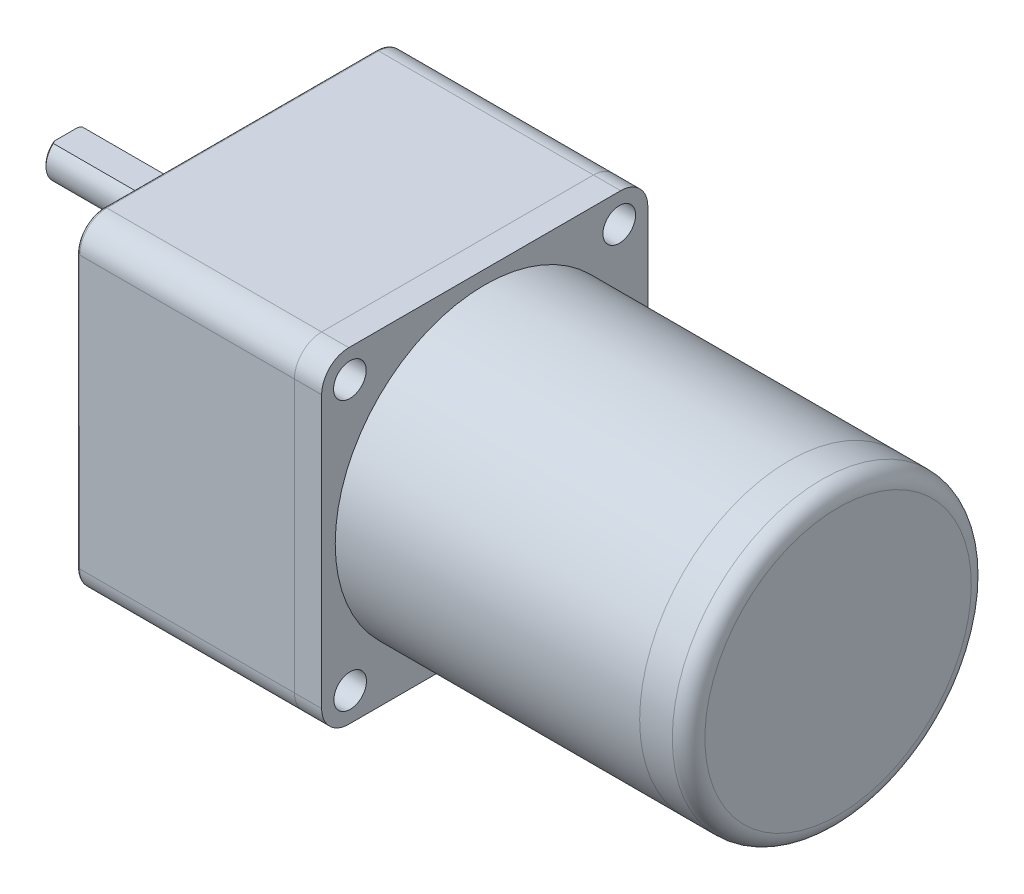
ISO-10303-21;
HEADER;
FILE_DESCRIPTION(('STEP AP214'),'2;1');
FILE_NAME('part.step','',(''),(''),'','','');
FILE_SCHEMA(('AUTOMOTIVE_DESIGN { 1 0 10303 214 1 1 1 1 }'));
ENDSEC;
DATA;
#1=APPLICATION_CONTEXT('core data for automotive mechanical design processes');
#2=APPLICATION_PROTOCOL_DEFINITION('international standard','automotive_design',2000,#1);
#3=PRODUCT_CONTEXT('',#1,'mechanical');
#4=PRODUCT('Part','Part','',(#3));
#5=PRODUCT_RELATED_PRODUCT_CATEGORY('part','',(#4));
#6=PRODUCT_DEFINITION_FORMATION('','',#4);
#7=PRODUCT_DEFINITION_CONTEXT('part definition',#1,'design');
#8=PRODUCT_DEFINITION('design','',#6,#7);
#9=PRODUCT_DEFINITION_SHAPE('','',#8);
#10=(LENGTH_UNIT() NAMED_UNIT(*) SI_UNIT(.MILLI.,.METRE.));
#11=(NAMED_UNIT(*) PLANE_ANGLE_UNIT() SI_UNIT($,.RADIAN.));
#12=(NAMED_UNIT(*) SI_UNIT($,.STERADIAN.) SOLID_ANGLE_UNIT());
#13=UNCERTAINTY_MEASURE_WITH_UNIT(LENGTH_MEASURE(1.E-05),#10,'distance_accuracy_value','');
#14=(GEOMETRIC_REPRESENTATION_CONTEXT(3) GLOBAL_UNCERTAINTY_ASSIGNED_CONTEXT((#13)) GLOBAL_UNIT_ASSIGNED_CONTEXT((#10,
#11,#12)) REPRESENTATION_CONTEXT('',''));
#15=CARTESIAN_POINT('',(0.,0.,0.));
#16=DIRECTION('',(0.,0.,1.));
#17=DIRECTION('',(1.,0.,0.));
#18=AXIS2_PLACEMENT_3D('',#15,#16,#17);
#19=CARTESIAN_POINT('',(-32.,10.,0.));
#20=DIRECTION('',(1.,0.,0.));
#21=DIRECTION('',(0.,0.,-1.));
#22=AXIS2_PLACEMENT_3D('',#19,#20,#21);
#23=CYLINDRICAL_SURFACE('',#22,4.);
#24=DIRECTION('',(-1.,0.,0.));
#25=VECTOR('',#24,1.);
#26=CARTESIAN_POINT('',(-7.,13.,2.64575131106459));
#27=LINE('',#26,#25);
#28=CARTESIAN_POINT('',(-7.,13.,2.64575131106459));
#29=VERTEX_POINT('',#28);
#30=CARTESIAN_POINT('',(-31.7,13.,2.64575131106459));
#31=VERTEX_POINT('',#30);
#32=EDGE_CURVE('E89',#29,#31,#27,.T.);
#33=ORIENTED_EDGE('',*,*,#32,.T.);
#34=CARTESIAN_POINT('',(-31.7,10.,0.));
#35=DIRECTION('',(-1.,0.,0.));
#36=DIRECTION('',(0.,0.,1.));
#37=AXIS2_PLACEMENT_3D('',#34,#35,#36);
#38=CIRCLE('',#37,4.);
#39=CARTESIAN_POINT('',(-31.7,13.,-2.64575131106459));
#40=VERTEX_POINT('',#39);
#41=EDGE_CURVE('E12',#31,#40,#38,.F.);
#42=ORIENTED_EDGE('',*,*,#41,.T.);
#43=DIRECTION('',(-1.,0.,0.));
#44=VECTOR('',#43,1.);
#45=CARTESIAN_POINT('',(-7.,13.,-2.64575131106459));
#46=LINE('',#45,#44);
#47=CARTESIAN_POINT('',(-7.,13.,-2.64575131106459));
#48=VERTEX_POINT('',#47);
#49=EDGE_CURVE('E87',#48,#40,#46,.T.);
#50=ORIENTED_EDGE('',*,*,#49,.F.);
#51=CARTESIAN_POINT('',(-7.,10.,0.));
#52=DIRECTION('',(-1.,0.,0.));
#53=DIRECTION('',(0.,0.,1.));
#54=AXIS2_PLACEMENT_3D('',#51,#52,#53);
#55=CIRCLE('',#54,4.);
#56=EDGE_CURVE('E80',#29,#48,#55,.T.);
#57=ORIENTED_EDGE('',*,*,#56,.F.);
#58=EDGE_LOOP('',(#33,#42,#50,#57));
#59=FACE_BOUND('',#58,.T.);
#60=CARTESIAN_POINT('',(-3.,10.,0.));
#61=DIRECTION('',(-1.,0.,0.));
#62=DIRECTION('',(0.,0.,1.));
#63=AXIS2_PLACEMENT_3D('',#60,#61,#62);
#64=CIRCLE('',#63,4.);
#65=CARTESIAN_POINT('',(-3.,10.,4.));
#66=VERTEX_POINT('',#65);
#67=EDGE_CURVE('E93',#66,#66,#64,.T.);
#68=ORIENTED_EDGE('',*,*,#67,.T.);
#69=EDGE_LOOP('',(#68));
#70=FACE_BOUND('',#69,.T.);
#71=ADVANCED_FACE('F46',(#59,#70),#23,.T.);
#72=CARTESIAN_POINT('',(-32.,10.,0.));
#73=DIRECTION('',(-1.,0.,0.));
#74=DIRECTION('',(0.,0.,1.));
#75=AXIS2_PLACEMENT_3D('',#72,#73,#74);
#76=PLANE('',#75);
#77=DIRECTION('',(0.,0.,1.));
#78=VECTOR('',#77,1.);
#79=CARTESIAN_POINT('',(-32.,13.,2.64575131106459));
#80=LINE('',#79,#78);
#81=CARTESIAN_POINT('',(-32.,13.,-2.16564078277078));
#82=VERTEX_POINT('',#81);
#83=CARTESIAN_POINT('',(-32.,13.,2.16564078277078));
#84=VERTEX_POINT('',#83);
#85=EDGE_CURVE('E84',#82,#84,#80,.T.);
#86=ORIENTED_EDGE('',*,*,#85,.F.);
#87=CARTESIAN_POINT('',(-32.,10.,0.));
#88=DIRECTION('',(-1.,0.,0.));
#89=DIRECTION('',(0.,0.,1.));
#90=AXIS2_PLACEMENT_3D('',#87,#88,#89);
#91=CIRCLE('',#90,3.70000000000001);
#92=EDGE_CURVE('E99',#82,#84,#91,.T.);
#93=ORIENTED_EDGE('',*,*,#92,.T.);
#94=EDGE_LOOP('',(#86,#93));
#95=FACE_BOUND('',#94,.T.);
#96=ADVANCED_FACE('F115',(#95),#76,.T.);
#97=CARTESIAN_POINT('',(-3.,10.,0.));
#98=DIRECTION('',(-1.,0.,0.));
#99=DIRECTION('',(0.,0.,1.));
#100=AXIS2_PLACEMENT_3D('',#97,#98,#99);
#101=PLANE('',#100);
#102=ORIENTED_EDGE('',*,*,#67,.F.);
#103=EDGE_LOOP('',(#102));
#104=FACE_BOUND('',#103,.T.);
#105=ADVANCED_FACE('F114',(#104),#101,.F.);
#106=CARTESIAN_POINT('',(-7.,13.,2.64575131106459));
#107=DIRECTION('',(0.,-1.,0.));
#108=DIRECTION('',(0.,0.,-1.));
#109=AXIS2_PLACEMENT_3D('',#106,#107,#108);
#110=PLANE('',#109);
#111=ORIENTED_EDGE('',*,*,#85,.T.);
#112=CARTESIAN_POINT('',(-32.,13.,2.16564078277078));
#113=CARTESIAN_POINT('',(-31.9761619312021,13.,2.20636622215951));
#114=CARTESIAN_POINT('',(-31.95199678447,13.,2.2468991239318));
#115=CARTESIAN_POINT('',(-31.9030718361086,13.,2.32759423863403));
#116=CARTESIAN_POINT('',(-31.8783121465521,13.,2.36775651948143));
#117=CARTESIAN_POINT('',(-31.8282492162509,13.,2.44773910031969));
#118=CARTESIAN_POINT('',(-31.80294598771,13.,2.48755940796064));
#119=CARTESIAN_POINT('',(-31.7518371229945,13.,2.56688695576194));
#120=CARTESIAN_POINT('',(-31.7260313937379,13.,2.60639413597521));
#121=CARTESIAN_POINT('',(-31.7000000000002,13.,2.64575131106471));
#122=B_SPLINE_CURVE_WITH_KNOTS('',3,(#112,#113,#114,#115,#116,#117,#118,#119,#120,#121),
.UNSPECIFIED.,.F.,.F.,(4,2,2,2,4),(0.,0.141564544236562,0.28310260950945,0.424637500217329,
0.566198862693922),.UNSPECIFIED.);
#123=EDGE_CURVE('E55',#84,#31,#122,.T.);
#124=ORIENTED_EDGE('',*,*,#123,.T.);
#125=ORIENTED_EDGE('',*,*,#32,.F.);
#126=DIRECTION('',(0.,0.,1.));
#127=VECTOR('',#126,1.);
#128=CARTESIAN_POINT('',(-7.,13.,2.64575131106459));
#129=LINE('',#128,#127);
#130=EDGE_CURVE('E83',#48,#29,#129,.T.);
#131=ORIENTED_EDGE('',*,*,#130,.F.);
#132=ORIENTED_EDGE('',*,*,#49,.T.);
#133=CARTESIAN_POINT('',(-31.7,13.,-2.64575131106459));
#134=CARTESIAN_POINT('',(-31.7260313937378,13.,-2.60639413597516));
#135=CARTESIAN_POINT('',(-31.7518371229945,13.,-2.56688695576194));
#136=CARTESIAN_POINT('',(-31.80294598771,13.,-2.48755940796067));
#137=CARTESIAN_POINT('',(-31.8282492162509,13.,-2.44773910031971));
#138=CARTESIAN_POINT('',(-31.878312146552,13.,-2.36775651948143));
#139=CARTESIAN_POINT('',(-31.9030718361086,13.,-2.32759423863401));
#140=CARTESIAN_POINT('',(-31.9519967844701,13.,-2.24689912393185));
#141=CARTESIAN_POINT('',(-31.9761619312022,13.,-2.20636622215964));
#142=CARTESIAN_POINT('',(-32.0000000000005,13.,-2.16564078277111));
#143=B_SPLINE_CURVE_WITH_KNOTS('',3,(#133,#134,#135,#136,#137,#138,#139,#140,#141,#142),
.UNSPECIFIED.,.F.,.F.,(4,2,2,2,4),(0.,0.141561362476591,0.283096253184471,0.424634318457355,
0.566198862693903),.UNSPECIFIED.);
#144=EDGE_CURVE('E102',#40,#82,#143,.T.);
#145=ORIENTED_EDGE('',*,*,#144,.T.);
#146=EDGE_LOOP('',(#111,#124,#125,#131,#132,#145));
#147=FACE_BOUND('',#146,.T.);
#148=ADVANCED_FACE('F86',(#147),#110,.F.);
#149=CARTESIAN_POINT('',(-7.,10.,0.));
#150=DIRECTION('',(-1.,0.,0.));
#151=DIRECTION('',(0.,0.,1.));
#152=AXIS2_PLACEMENT_3D('',#149,#150,#151);
#153=PLANE('',#152);
#154=ORIENTED_EDGE('',*,*,#56,.T.);
#155=ORIENTED_EDGE('',*,*,#130,.T.);
#156=EDGE_LOOP('',(#154,#155));
#157=FACE_BOUND('',#156,.T.);
#158=ADVANCED_FACE('F82',(#157),#153,.T.);
#159=CARTESIAN_POINT('',(-32.,10.,0.));
#160=DIRECTION('',(1.,0.,0.));
#161=DIRECTION('',(0.,0.,-1.));
#162=AXIS2_PLACEMENT_3D('',#159,#160,#161);
#163=CONICAL_SURFACE('',#162,3.70000000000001,0.785398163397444);
#164=ORIENTED_EDGE('',*,*,#144,.F.);
#165=ORIENTED_EDGE('',*,*,#41,.F.);
#166=ORIENTED_EDGE('',*,*,#123,.F.);
#167=ORIENTED_EDGE('',*,*,#92,.F.);
#168=EDGE_LOOP('',(#164,#165,#166,#167));
#169=FACE_BOUND('',#168,.T.);
#170=ADVANCED_FACE('F48',(#169),#163,.T.);
#171=CLOSED_SHELL('',(#71,#96,#105,#148,#158,#170));
#172=MANIFOLD_SOLID_BREP('B2',#171);
#173=CARTESIAN_POINT('',(-3.,10.,0.));
#174=DIRECTION('',(1.,0.,0.));
#175=DIRECTION('',(0.,0.,-1.));
#176=AXIS2_PLACEMENT_3D('',#173,#174,#175);
#177=CYLINDRICAL_SURFACE('',#176,12.);
#178=CARTESIAN_POINT('',(-2.5,10.,0.));
#179=DIRECTION('',(-1.,0.,0.));
#180=DIRECTION('',(0.,0.,1.));
#181=AXIS2_PLACEMENT_3D('',#178,#179,#180);
#182=CIRCLE('',#181,12.);
#183=CARTESIAN_POINT('',(-2.5,10.,12.));
#184=VERTEX_POINT('',#183);
#185=EDGE_CURVE('E45',#184,#184,#182,.F.);
#186=ORIENTED_EDGE('',*,*,#185,.T.);
#187=EDGE_LOOP('',(#186));
#188=FACE_BOUND('',#187,.T.);
#189=CARTESIAN_POINT('',(0.,10.,0.));
#190=DIRECTION('',(-1.,0.,0.));
#191=DIRECTION('',(0.,0.,1.));
#192=AXIS2_PLACEMENT_3D('',#189,#190,#191);
#193=CIRCLE('',#192,12.);
#194=CARTESIAN_POINT('',(0.,10.,12.));
#195=VERTEX_POINT('',#194);
#196=EDGE_CURVE('E188',#195,#195,#193,.T.);
#197=ORIENTED_EDGE('',*,*,#196,.T.);
#198=EDGE_LOOP('',(#197));
#199=FACE_BOUND('',#198,.T.);
#200=ADVANCED_FACE('F177',(#188,#199),#177,.T.);
#201=CARTESIAN_POINT('',(-3.,10.,0.));
#202=DIRECTION('',(-1.,0.,0.));
#203=DIRECTION('',(0.,0.,1.));
#204=AXIS2_PLACEMENT_3D('',#201,#202,#203);
#205=PLANE('',#204);
#206=CARTESIAN_POINT('',(-3.,10.,0.));
#207=DIRECTION('',(-1.,0.,0.));
#208=DIRECTION('',(0.,0.,1.));
#209=AXIS2_PLACEMENT_3D('',#206,#207,#208);
#210=CIRCLE('',#209,11.5);
#211=CARTESIAN_POINT('',(-3.,10.,11.5));
#212=VERTEX_POINT('',#211);
#213=EDGE_CURVE('E184',#212,#212,#210,.T.);
#214=ORIENTED_EDGE('',*,*,#213,.T.);
#215=EDGE_LOOP('',(#214));
#216=FACE_BOUND('',#215,.T.);
#217=ADVANCED_FACE('F198',(#216),#205,.T.);
#218=CARTESIAN_POINT('',(0.,10.,0.));
#219=DIRECTION('',(-1.,0.,0.));
#220=DIRECTION('',(0.,0.,1.));
#221=AXIS2_PLACEMENT_3D('',#218,#219,#220);
#222=PLANE('',#221);
#223=ORIENTED_EDGE('',*,*,#196,.F.);
#224=EDGE_LOOP('',(#223));
#225=FACE_BOUND('',#224,.T.);
#226=ADVANCED_FACE('F196',(#225),#222,.F.);
#227=CARTESIAN_POINT('',(-2.5,10.,0.));
#228=DIRECTION('',(-1.,0.,0.));
#229=DIRECTION('',(0.,0.,1.));
#230=AXIS2_PLACEMENT_3D('',#227,#228,#229);
#231=TOROIDAL_SURFACE('',#230,11.5,0.5);
#232=ORIENTED_EDGE('',*,*,#185,.F.);
#233=EDGE_LOOP('',(#232));
#234=FACE_BOUND('',#233,.T.);
#235=ORIENTED_EDGE('',*,*,#213,.F.);
#236=EDGE_LOOP('',(#235));
#237=FACE_BOUND('',#236,.T.);
#238=ADVANCED_FACE('F179',(#234,#237),#231,.T.);
#239=CLOSED_SHELL('',(#200,#217,#226,#238));
#240=MANIFOLD_SOLID_BREP('B6',#239);
#241=CARTESIAN_POINT('',(110.,0.,0.));
#242=DIRECTION('',(-1.,0.,0.));
#243=DIRECTION('',(0.,0.,1.));
#244=AXIS2_PLACEMENT_3D('',#241,#242,#243);
#245=CYLINDRICAL_SURFACE('',#244,27.5);
#246=CARTESIAN_POINT('',(107.,0.,0.));
#247=DIRECTION('',(1.,0.,0.));
#248=DIRECTION('',(0.,0.,-1.));
#249=AXIS2_PLACEMENT_3D('',#246,#247,#248);
#250=CIRCLE('',#249,27.5);
#251=CARTESIAN_POINT('',(107.,0.,-27.5));
#252=VERTEX_POINT('',#251);
#253=EDGE_CURVE('E176',#252,#252,#250,.F.);
#254=ORIENTED_EDGE('',*,*,#253,.T.);
#255=EDGE_LOOP('',(#254));
#256=FACE_BOUND('',#255,.T.);
#257=CARTESIAN_POINT('',(101.,0.,0.));
#258=DIRECTION('',(1.,0.,0.));
#259=DIRECTION('',(0.,0.,-1.));
#260=AXIS2_PLACEMENT_3D('',#257,#258,#259);
#261=CIRCLE('',#260,27.5);
#262=CARTESIAN_POINT('',(101.,0.,-27.5));
#263=VERTEX_POINT('',#262);
#264=EDGE_CURVE('E252',#263,#263,#261,.T.);
#265=ORIENTED_EDGE('',*,*,#264,.T.);
#266=EDGE_LOOP('',(#265));
#267=FACE_BOUND('',#266,.T.);
#268=ADVANCED_FACE('F241',(#256,#267),#245,.T.);
#269=CARTESIAN_POINT('',(110.,0.,0.));
#270=DIRECTION('',(1.,0.,0.));
#271=DIRECTION('',(0.,0.,-1.));
#272=AXIS2_PLACEMENT_3D('',#269,#270,#271);
#273=PLANE('',#272);
#274=CARTESIAN_POINT('',(110.,0.,0.));
#275=DIRECTION('',(1.,0.,0.));
#276=DIRECTION('',(0.,0.,-1.));
#277=AXIS2_PLACEMENT_3D('',#274,#275,#276);
#278=CIRCLE('',#277,24.5);
#279=CARTESIAN_POINT('',(110.,0.,-24.5));
#280=VERTEX_POINT('',#279);
#281=EDGE_CURVE('E248',#280,#280,#278,.T.);
#282=ORIENTED_EDGE('',*,*,#281,.T.);
#283=EDGE_LOOP('',(#282));
#284=FACE_BOUND('',#283,.T.);
#285=ADVANCED_FACE('F262',(#284),#273,.T.);
#286=CARTESIAN_POINT('',(101.,0.,0.));
#287=DIRECTION('',(1.,0.,0.));
#288=DIRECTION('',(0.,0.,-1.));
#289=AXIS2_PLACEMENT_3D('',#286,#287,#288);
#290=PLANE('',#289);
#291=ORIENTED_EDGE('',*,*,#264,.F.);
#292=EDGE_LOOP('',(#291));
#293=FACE_BOUND('',#292,.T.);
#294=ADVANCED_FACE('F260',(#293),#290,.F.);
#295=CARTESIAN_POINT('',(107.,0.,0.));
#296=DIRECTION('',(1.,0.,0.));
#297=DIRECTION('',(0.,0.,-1.));
#298=AXIS2_PLACEMENT_3D('',#295,#296,#297);
#299=TOROIDAL_SURFACE('',#298,24.5,3.);
#300=ORIENTED_EDGE('',*,*,#253,.F.);
#301=EDGE_LOOP('',(#300));
#302=FACE_BOUND('',#301,.T.);
#303=ORIENTED_EDGE('',*,*,#281,.F.);
#304=EDGE_LOOP('',(#303));
#305=FACE_BOUND('',#304,.T.);
#306=ADVANCED_FACE('F243',(#302,#305),#299,.T.);
#307=CLOSED_SHELL('',(#268,#285,#294,#306));
#308=MANIFOLD_SOLID_BREP('B40',#307);
#309=CARTESIAN_POINT('',(101.,0.,0.));
#310=DIRECTION('',(-1.,0.,0.));
#311=DIRECTION('',(0.,0.,1.));
#312=AXIS2_PLACEMENT_3D('',#309,#310,#311);
#313=CYLINDRICAL_SURFACE('',#312,27.5);
#314=CARTESIAN_POINT('',(101.,0.,0.));
#315=DIRECTION('',(1.,0.,0.));
#316=DIRECTION('',(0.,0.,-1.));
#317=AXIS2_PLACEMENT_3D('',#314,#315,#316);
#318=CIRCLE('',#317,27.5);
#319=CARTESIAN_POINT('',(101.,0.,-27.5));
#320=VERTEX_POINT('',#319);
#321=EDGE_CURVE('E240',#320,#320,#318,.T.);
#322=ORIENTED_EDGE('',*,*,#321,.F.);
#323=EDGE_LOOP('',(#322));
#324=FACE_BOUND('',#323,.T.);
#325=CARTESIAN_POINT('',(45.,0.,0.));
#326=DIRECTION('',(1.,0.,0.));
#327=DIRECTION('',(0.,0.,-1.));
#328=AXIS2_PLACEMENT_3D('',#325,#326,#327);
#329=CIRCLE('',#328,27.5);
#330=CARTESIAN_POINT('',(45.,0.,-27.5));
#331=VERTEX_POINT('',#330);
#332=EDGE_CURVE('E310',#331,#331,#329,.T.);
#333=ORIENTED_EDGE('',*,*,#332,.T.);
#334=EDGE_LOOP('',(#333));
#335=FACE_BOUND('',#334,.T.);
#336=ADVANCED_FACE('F307',(#324,#335),#313,.T.);
#337=CARTESIAN_POINT('',(101.,0.,0.));
#338=DIRECTION('',(1.,0.,0.));
#339=DIRECTION('',(0.,0.,-1.));
#340=AXIS2_PLACEMENT_3D('',#337,#338,#339);
#341=PLANE('',#340);
#342=ORIENTED_EDGE('',*,*,#321,.T.);
#343=EDGE_LOOP('',(#342));
#344=FACE_BOUND('',#343,.T.);
#345=ADVANCED_FACE('F322',(#344),#341,.T.);
#346=CARTESIAN_POINT('',(45.,0.,0.));
#347=DIRECTION('',(1.,0.,0.));
#348=DIRECTION('',(0.,0.,-1.));
#349=AXIS2_PLACEMENT_3D('',#346,#347,#348);
#350=PLANE('',#349);
#351=ORIENTED_EDGE('',*,*,#332,.F.);
#352=EDGE_LOOP('',(#351));
#353=FACE_BOUND('',#352,.T.);
#354=ADVANCED_FACE('F320',(#353),#350,.F.);
#355=CLOSED_SHELL('',(#336,#345,#354));
#356=MANIFOLD_SOLID_BREP('B171',#355);
#357=CARTESIAN_POINT('',(45.,25.,-25.));
#358=DIRECTION('',(-1.,0.,0.));
#359=DIRECTION('',(0.,0.,1.));
#360=AXIS2_PLACEMENT_3D('',#357,#358,#359);
#361=CYLINDRICAL_SURFACE('',#360,5.);
#362=CARTESIAN_POINT('',(40.,25.,-25.));
#363=DIRECTION('',(1.,0.,0.));
#364=DIRECTION('',(0.,0.,1.));
#365=AXIS2_PLACEMENT_3D('',#362,#363,#364);
#366=CIRCLE('',#365,5.);
#367=CARTESIAN_POINT('',(40.,25.,-30.));
#368=VERTEX_POINT('',#367);
#369=CARTESIAN_POINT('',(40.,30.,-25.));
#370=VERTEX_POINT('',#369);
#371=EDGE_CURVE('E455',#368,#370,#366,.T.);
#372=ORIENTED_EDGE('',*,*,#371,.T.);
#373=DIRECTION('',(-1.,0.,0.));
#374=VECTOR('',#373,1.);
#375=CARTESIAN_POINT('',(45.,30.,-25.));
#376=LINE('',#375,#374);
#377=CARTESIAN_POINT('',(45.,30.,-25.));
#378=VERTEX_POINT('',#377);
#379=EDGE_CURVE('E305',#378,#370,#376,.T.);
#380=ORIENTED_EDGE('',*,*,#379,.F.);
#381=CARTESIAN_POINT('',(45.,25.,-25.));
#382=DIRECTION('',(1.,0.,0.));
#383=DIRECTION('',(0.,0.,1.));
#384=AXIS2_PLACEMENT_3D('',#381,#382,#383);
#385=CIRCLE('',#384,5.);
#386=CARTESIAN_POINT('',(45.,25.,-30.));
#387=VERTEX_POINT('',#386);
#388=EDGE_CURVE('E469',#387,#378,#385,.T.);
#389=ORIENTED_EDGE('',*,*,#388,.F.);
#390=DIRECTION('',(-1.,0.,0.));
#391=VECTOR('',#390,1.);
#392=CARTESIAN_POINT('',(45.,25.,-30.));
#393=LINE('',#392,#391);
#394=EDGE_CURVE('E451',#387,#368,#393,.T.);
#395=ORIENTED_EDGE('',*,*,#394,.T.);
#396=EDGE_LOOP('',(#372,#380,#389,#395));
#397=FACE_BOUND('',#396,.T.);
#398=ADVANCED_FACE('F357',(#397),#361,.T.);
#399=CARTESIAN_POINT('',(45.,30.,25.));
#400=DIRECTION('',(0.,-1.,0.));
#401=DIRECTION('',(0.,0.,-1.));
#402=AXIS2_PLACEMENT_3D('',#399,#400,#401);
#403=PLANE('',#402);
#404=DIRECTION('',(0.,0.,1.));
#405=VECTOR('',#404,1.);
#406=CARTESIAN_POINT('',(40.,30.,25.));
#407=LINE('',#406,#405);
#408=CARTESIAN_POINT('',(40.,30.,25.));
#409=VERTEX_POINT('',#408);
#410=EDGE_CURVE('E458',#370,#409,#407,.T.);
#411=ORIENTED_EDGE('',*,*,#410,.T.);
#412=DIRECTION('',(-1.,0.,0.));
#413=VECTOR('',#412,1.);
#414=CARTESIAN_POINT('',(45.,30.,25.));
#415=LINE('',#414,#413);
#416=CARTESIAN_POINT('',(45.,30.,25.));
#417=VERTEX_POINT('',#416);
#418=EDGE_CURVE('E366',#417,#409,#415,.T.);
#419=ORIENTED_EDGE('',*,*,#418,.F.);
#420=DIRECTION('',(0.,0.,1.));
#421=VECTOR('',#420,1.);
#422=CARTESIAN_POINT('',(45.,30.,25.));
#423=LINE('',#422,#421);
#424=EDGE_CURVE('E418',#378,#417,#423,.T.);
#425=ORIENTED_EDGE('',*,*,#424,.F.);
#426=ORIENTED_EDGE('',*,*,#379,.T.);
#427=EDGE_LOOP('',(#411,#419,#425,#426));
#428=FACE_BOUND('',#427,.T.);
#429=ADVANCED_FACE('F523',(#428),#403,.F.);
#430=CARTESIAN_POINT('',(45.,25.,25.));
#431=DIRECTION('',(-1.,0.,0.));
#432=DIRECTION('',(0.,0.,1.));
#433=AXIS2_PLACEMENT_3D('',#430,#431,#432);
#434=CYLINDRICAL_SURFACE('',#433,5.);
#435=CARTESIAN_POINT('',(40.,25.,25.));
#436=DIRECTION('',(1.,0.,0.));
#437=DIRECTION('',(0.,0.,1.));
#438=AXIS2_PLACEMENT_3D('',#435,#436,#437);
#439=CIRCLE('',#438,5.);
#440=CARTESIAN_POINT('',(40.,25.,30.));
#441=VERTEX_POINT('',#440);
#442=EDGE_CURVE('E460',#409,#441,#439,.T.);
#443=ORIENTED_EDGE('',*,*,#442,.T.);
#444=DIRECTION('',(-1.,0.,0.));
#445=VECTOR('',#444,1.);
#446=CARTESIAN_POINT('',(45.,25.,30.));
#447=LINE('',#446,#445);
#448=CARTESIAN_POINT('',(45.,25.,30.));
#449=VERTEX_POINT('',#448);
#450=EDGE_CURVE('E476',#449,#441,#447,.T.);
#451=ORIENTED_EDGE('',*,*,#450,.F.);
#452=CARTESIAN_POINT('',(45.,25.,25.));
#453=DIRECTION('',(1.,0.,0.));
#454=DIRECTION('',(0.,0.,1.));
#455=AXIS2_PLACEMENT_3D('',#452,#453,#454);
#456=CIRCLE('',#455,5.);
#457=EDGE_CURVE('E624',#417,#449,#456,.T.);
#458=ORIENTED_EDGE('',*,*,#457,.F.);
#459=ORIENTED_EDGE('',*,*,#418,.T.);
#460=EDGE_LOOP('',(#443,#451,#458,#459));
#461=FACE_BOUND('',#460,.T.);
#462=ADVANCED_FACE('F527',(#461),#434,.T.);
#463=CARTESIAN_POINT('',(45.,-25.,30.));
#464=DIRECTION('',(0.,0.,-1.));
#465=DIRECTION('',(-1.,0.,0.));
#466=AXIS2_PLACEMENT_3D('',#463,#464,#465);
#467=PLANE('',#466);
#468=DIRECTION('',(0.,-1.,0.));
#469=VECTOR('',#468,1.);
#470=CARTESIAN_POINT('',(40.,-25.,30.));
#471=LINE('',#470,#469);
#472=CARTESIAN_POINT('',(40.,-25.,30.));
#473=VERTEX_POINT('',#472);
#474=EDGE_CURVE('E462',#441,#473,#471,.T.);
#475=ORIENTED_EDGE('',*,*,#474,.T.);
#476=DIRECTION('',(-1.,0.,0.));
#477=VECTOR('',#476,1.);
#478=CARTESIAN_POINT('',(45.,-25.,30.));
#479=LINE('',#478,#477);
#480=CARTESIAN_POINT('',(45.,-25.,30.));
#481=VERTEX_POINT('',#480);
#482=EDGE_CURVE('E473',#481,#473,#479,.T.);
#483=ORIENTED_EDGE('',*,*,#482,.F.);
#484=DIRECTION('',(0.,-1.,0.));
#485=VECTOR('',#484,1.);
#486=CARTESIAN_POINT('',(45.,-25.,30.));
#487=LINE('',#486,#485);
#488=EDGE_CURVE('E626',#449,#481,#487,.T.);
#489=ORIENTED_EDGE('',*,*,#488,.F.);
#490=ORIENTED_EDGE('',*,*,#450,.T.);
#491=EDGE_LOOP('',(#475,#483,#489,#490));
#492=FACE_BOUND('',#491,.T.);
#493=ADVANCED_FACE('F531',(#492),#467,.F.);
#494=CARTESIAN_POINT('',(45.,-25.,25.));
#495=DIRECTION('',(-1.,0.,0.));
#496=DIRECTION('',(0.,0.,1.));
#497=AXIS2_PLACEMENT_3D('',#494,#495,#496);
#498=CYLINDRICAL_SURFACE('',#497,5.);
#499=CARTESIAN_POINT('',(40.,-25.,25.));
#500=DIRECTION('',(1.,0.,0.));
#501=DIRECTION('',(0.,0.,1.));
#502=AXIS2_PLACEMENT_3D('',#499,#500,#501);
#503=CIRCLE('',#502,5.);
#504=CARTESIAN_POINT('',(40.,-30.,25.));
#505=VERTEX_POINT('',#504);
#506=EDGE_CURVE('E464',#473,#505,#503,.T.);
#507=ORIENTED_EDGE('',*,*,#506,.T.);
#508=DIRECTION('',(-1.,0.,0.));
#509=VECTOR('',#508,1.);
#510=CARTESIAN_POINT('',(45.,-30.,25.));
#511=LINE('',#510,#509);
#512=CARTESIAN_POINT('',(45.,-30.,25.));
#513=VERTEX_POINT('',#512);
#514=EDGE_CURVE('E446',#513,#505,#511,.T.);
#515=ORIENTED_EDGE('',*,*,#514,.F.);
#516=CARTESIAN_POINT('',(45.,-25.,25.));
#517=DIRECTION('',(1.,0.,0.));
#518=DIRECTION('',(0.,0.,1.));
#519=AXIS2_PLACEMENT_3D('',#516,#517,#518);
#520=CIRCLE('',#519,5.);
#521=EDGE_CURVE('E437',#481,#513,#520,.T.);
#522=ORIENTED_EDGE('',*,*,#521,.F.);
#523=ORIENTED_EDGE('',*,*,#482,.T.);
#524=EDGE_LOOP('',(#507,#515,#522,#523));
#525=FACE_BOUND('',#524,.T.);
#526=ADVANCED_FACE('F537',(#525),#498,.T.);
#527=CARTESIAN_POINT('',(45.,-30.,25.));
#528=DIRECTION('',(0.,1.,0.));
#529=DIRECTION('',(0.,0.,1.));
#530=AXIS2_PLACEMENT_3D('',#527,#528,#529);
#531=PLANE('',#530);
#532=DIRECTION('',(0.,0.,-1.));
#533=VECTOR('',#532,1.);
#534=CARTESIAN_POINT('',(40.,-30.,25.));
#535=LINE('',#534,#533);
#536=CARTESIAN_POINT('',(40.,-30.,-25.));
#537=VERTEX_POINT('',#536);
#538=EDGE_CURVE('E445',#505,#537,#535,.T.);
#539=ORIENTED_EDGE('',*,*,#538,.T.);
#540=DIRECTION('',(-1.,0.,0.));
#541=VECTOR('',#540,1.);
#542=CARTESIAN_POINT('',(45.,-30.,-25.));
#543=LINE('',#542,#541);
#544=CARTESIAN_POINT('',(45.,-30.,-25.));
#545=VERTEX_POINT('',#544);
#546=EDGE_CURVE('E442',#545,#537,#543,.T.);
#547=ORIENTED_EDGE('',*,*,#546,.F.);
#548=DIRECTION('',(0.,0.,-1.));
#549=VECTOR('',#548,1.);
#550=CARTESIAN_POINT('',(45.,-30.,25.));
#551=LINE('',#550,#549);
#552=EDGE_CURVE('E431',#513,#545,#551,.T.);
#553=ORIENTED_EDGE('',*,*,#552,.F.);
#554=ORIENTED_EDGE('',*,*,#514,.T.);
#555=EDGE_LOOP('',(#539,#547,#553,#554));
#556=FACE_BOUND('',#555,.T.);
#557=ADVANCED_FACE('F443',(#556),#531,.F.);
#558=CARTESIAN_POINT('',(45.,-25.,-25.));
#559=DIRECTION('',(-1.,0.,0.));
#560=DIRECTION('',(0.,0.,1.));
#561=AXIS2_PLACEMENT_3D('',#558,#559,#560);
#562=CYLINDRICAL_SURFACE('',#561,5.);
#563=CARTESIAN_POINT('',(40.,-25.,-25.));
#564=DIRECTION('',(1.,0.,0.));
#565=DIRECTION('',(0.,0.,-1.));
#566=AXIS2_PLACEMENT_3D('',#563,#564,#565);
#567=CIRCLE('',#566,5.);
#568=CARTESIAN_POINT('',(40.,-25.,-30.));
#569=VERTEX_POINT('',#568);
#570=EDGE_CURVE('E404',#537,#569,#567,.T.);
#571=ORIENTED_EDGE('',*,*,#570,.T.);
#572=DIRECTION('',(-1.,0.,0.));
#573=VECTOR('',#572,1.);
#574=CARTESIAN_POINT('',(45.,-25.,-30.));
#575=LINE('',#574,#573);
#576=CARTESIAN_POINT('',(45.,-25.,-30.));
#577=VERTEX_POINT('',#576);
#578=EDGE_CURVE('E447',#577,#569,#575,.T.);
#579=ORIENTED_EDGE('',*,*,#578,.F.);
#580=CARTESIAN_POINT('',(45.,-25.,-25.));
#581=DIRECTION('',(1.,0.,0.));
#582=DIRECTION('',(0.,0.,-1.));
#583=AXIS2_PLACEMENT_3D('',#580,#581,#582);
#584=CIRCLE('',#583,5.);
#585=EDGE_CURVE('E435',#545,#577,#584,.T.);
#586=ORIENTED_EDGE('',*,*,#585,.F.);
#587=ORIENTED_EDGE('',*,*,#546,.T.);
#588=EDGE_LOOP('',(#571,#579,#586,#587));
#589=FACE_BOUND('',#588,.T.);
#590=ADVANCED_FACE('F449',(#589),#562,.T.);
#591=CARTESIAN_POINT('',(45.,-25.,-30.));
#592=DIRECTION('',(0.,0.,1.));
#593=DIRECTION('',(1.,0.,0.));
#594=AXIS2_PLACEMENT_3D('',#591,#592,#593);
#595=PLANE('',#594);
#596=DIRECTION('',(0.,1.,0.));
#597=VECTOR('',#596,1.);
#598=CARTESIAN_POINT('',(40.,-25.,-30.));
#599=LINE('',#598,#597);
#600=EDGE_CURVE('E410',#569,#368,#599,.T.);
#601=ORIENTED_EDGE('',*,*,#600,.T.);
#602=ORIENTED_EDGE('',*,*,#394,.F.);
#603=DIRECTION('',(0.,1.,0.));
#604=VECTOR('',#603,1.);
#605=CARTESIAN_POINT('',(45.,-25.,-30.));
#606=LINE('',#605,#604);
#607=EDGE_CURVE('E375',#577,#387,#606,.T.);
#608=ORIENTED_EDGE('',*,*,#607,.F.);
#609=ORIENTED_EDGE('',*,*,#578,.T.);
#610=EDGE_LOOP('',(#601,#602,#608,#609));
#611=FACE_BOUND('',#610,.T.);
#612=ADVANCED_FACE('F512',(#611),#595,.F.);
#613=CARTESIAN_POINT('',(45.,25.,-25.));
#614=DIRECTION('',(-1.,0.,0.));
#615=DIRECTION('',(0.,0.,1.));
#616=AXIS2_PLACEMENT_3D('',#613,#614,#615);
#617=PLANE('',#616);
#618=CARTESIAN_POINT('',(45.,24.8007290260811,24.8007290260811));
#619=DIRECTION('',(1.,0.,0.));
#620=DIRECTION('',(0.,0.,-1.));
#621=AXIS2_PLACEMENT_3D('',#618,#619,#620);
#622=CIRCLE('',#621,3.);
#623=CARTESIAN_POINT('',(45.,24.8007290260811,21.8007290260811));
#624=VERTEX_POINT('',#623);
#625=EDGE_CURVE('E485',#624,#624,#622,.T.);
#626=ORIENTED_EDGE('',*,*,#625,.F.);
#627=EDGE_LOOP('',(#626));
#628=FACE_BOUND('',#627,.T.);
#629=CARTESIAN_POINT('',(45.,24.7487373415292,-24.7487373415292));
#630=DIRECTION('',(1.,0.,0.));
#631=DIRECTION('',(0.,0.,-1.));
#632=AXIS2_PLACEMENT_3D('',#629,#630,#631);
#633=CIRCLE('',#632,3.);
#634=CARTESIAN_POINT('',(45.,24.7487373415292,-27.7487373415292));
#635=VERTEX_POINT('',#634);
#636=EDGE_CURVE('E610',#635,#635,#633,.T.);
#637=ORIENTED_EDGE('',*,*,#636,.F.);
#638=EDGE_LOOP('',(#637));
#639=FACE_BOUND('',#638,.T.);
#640=CARTESIAN_POINT('',(45.,-24.7487373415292,-24.7487373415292));
#641=DIRECTION('',(1.,0.,0.));
#642=DIRECTION('',(0.,0.,-1.));
#643=AXIS2_PLACEMENT_3D('',#640,#641,#642);
#644=CIRCLE('',#643,3.);
#645=CARTESIAN_POINT('',(45.,-24.7487373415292,-27.7487373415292));
#646=VERTEX_POINT('',#645);
#647=EDGE_CURVE('E612',#646,#646,#644,.T.);
#648=ORIENTED_EDGE('',*,*,#647,.F.);
#649=EDGE_LOOP('',(#648));
#650=FACE_BOUND('',#649,.T.);
#651=CARTESIAN_POINT('',(45.,-24.7487373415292,24.7487373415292));
#652=DIRECTION('',(1.,0.,0.));
#653=DIRECTION('',(0.,0.,-1.));
#654=AXIS2_PLACEMENT_3D('',#651,#652,#653);
#655=CIRCLE('',#654,3.);
#656=CARTESIAN_POINT('',(45.,-24.7487373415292,21.7487373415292));
#657=VERTEX_POINT('',#656);
#658=EDGE_CURVE('E617',#657,#657,#655,.T.);
#659=ORIENTED_EDGE('',*,*,#658,.F.);
#660=EDGE_LOOP('',(#659));
#661=FACE_BOUND('',#660,.T.);
#662=ORIENTED_EDGE('',*,*,#388,.T.);
#663=ORIENTED_EDGE('',*,*,#424,.T.);
#664=ORIENTED_EDGE('',*,*,#457,.T.);
#665=ORIENTED_EDGE('',*,*,#488,.T.);
#666=ORIENTED_EDGE('',*,*,#521,.T.);
#667=ORIENTED_EDGE('',*,*,#552,.T.);
#668=ORIENTED_EDGE('',*,*,#585,.T.);
#669=ORIENTED_EDGE('',*,*,#607,.T.);
#670=EDGE_LOOP('',(#662,#663,#664,#665,#666,#667,#668,#669));
#671=FACE_BOUND('',#670,.T.);
#672=ADVANCED_FACE('F433',(#628,#639,#650,#661,#671),#617,.F.);
#673=CARTESIAN_POINT('',(40.,25.,-25.));
#674=DIRECTION('',(-1.,0.,0.));
#675=DIRECTION('',(0.,0.,1.));
#676=AXIS2_PLACEMENT_3D('',#673,#674,#675);
#677=PLANE('',#676);
#678=CARTESIAN_POINT('',(40.,24.8007290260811,24.8007290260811));
#679=DIRECTION('',(-1.,0.,0.));
#680=DIRECTION('',(0.,0.,1.));
#681=AXIS2_PLACEMENT_3D('',#678,#679,#680);
#682=CIRCLE('',#681,3.);
#683=CARTESIAN_POINT('',(40.,24.8007290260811,27.8007290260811));
#684=VERTEX_POINT('',#683);
#685=EDGE_CURVE('E360',#684,#684,#682,.T.);
#686=ORIENTED_EDGE('',*,*,#685,.F.);
#687=EDGE_LOOP('',(#686));
#688=FACE_BOUND('',#687,.T.);
#689=CARTESIAN_POINT('',(40.,24.7487373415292,-24.7487373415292));
#690=DIRECTION('',(-1.,0.,0.));
#691=DIRECTION('',(0.,0.,1.));
#692=AXIS2_PLACEMENT_3D('',#689,#690,#691);
#693=CIRCLE('',#692,3.);
#694=CARTESIAN_POINT('',(40.,24.7487373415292,-21.7487373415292));
#695=VERTEX_POINT('',#694);
#696=EDGE_CURVE('E487',#695,#695,#693,.T.);
#697=ORIENTED_EDGE('',*,*,#696,.F.);
#698=EDGE_LOOP('',(#697));
#699=FACE_BOUND('',#698,.T.);
#700=CARTESIAN_POINT('',(40.,-24.7487373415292,-24.7487373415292));
#701=DIRECTION('',(-1.,0.,0.));
#702=DIRECTION('',(0.,0.,1.));
#703=AXIS2_PLACEMENT_3D('',#700,#701,#702);
#704=CIRCLE('',#703,3.);
#705=CARTESIAN_POINT('',(40.,-24.7487373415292,-21.7487373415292));
#706=VERTEX_POINT('',#705);
#707=EDGE_CURVE('E484',#706,#706,#704,.T.);
#708=ORIENTED_EDGE('',*,*,#707,.F.);
#709=EDGE_LOOP('',(#708));
#710=FACE_BOUND('',#709,.T.);
#711=CARTESIAN_POINT('',(40.,-24.7487373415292,24.7487373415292));
#712=DIRECTION('',(-1.,0.,0.));
#713=DIRECTION('',(0.,0.,1.));
#714=AXIS2_PLACEMENT_3D('',#711,#712,#713);
#715=CIRCLE('',#714,3.);
#716=CARTESIAN_POINT('',(40.,-24.7487373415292,27.7487373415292));
#717=VERTEX_POINT('',#716);
#718=EDGE_CURVE('E481',#717,#717,#715,.T.);
#719=ORIENTED_EDGE('',*,*,#718,.F.);
#720=EDGE_LOOP('',(#719));
#721=FACE_BOUND('',#720,.T.);
#722=ORIENTED_EDGE('',*,*,#371,.F.);
#723=ORIENTED_EDGE('',*,*,#600,.F.);
#724=ORIENTED_EDGE('',*,*,#570,.F.);
#725=ORIENTED_EDGE('',*,*,#538,.F.);
#726=ORIENTED_EDGE('',*,*,#506,.F.);
#727=ORIENTED_EDGE('',*,*,#474,.F.);
#728=ORIENTED_EDGE('',*,*,#442,.F.);
#729=ORIENTED_EDGE('',*,*,#410,.F.);
#730=EDGE_LOOP('',(#722,#723,#724,#725,#726,#727,#728,#729));
#731=FACE_BOUND('',#730,.T.);
#732=ADVANCED_FACE('F497',(#688,#699,#710,#721,#731),#677,.T.);
#733=CARTESIAN_POINT('',(12.,-24.7487373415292,24.7487373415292));
#734=DIRECTION('',(1.,0.,0.));
#735=DIRECTION('',(0.,0.,-1.));
#736=AXIS2_PLACEMENT_3D('',#733,#734,#735);
#737=CYLINDRICAL_SURFACE('',#736,3.);
#738=ORIENTED_EDGE('',*,*,#718,.T.);
#739=EDGE_LOOP('',(#738));
#740=FACE_BOUND('',#739,.T.);
#741=ORIENTED_EDGE('',*,*,#658,.T.);
#742=EDGE_LOOP('',(#741));
#743=FACE_BOUND('',#742,.T.);
#744=ADVANCED_FACE('F500',(#740,#743),#737,.F.);
#745=CARTESIAN_POINT('',(12.,-24.7487373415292,-24.7487373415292));
#746=DIRECTION('',(1.,0.,0.));
#747=DIRECTION('',(0.,0.,-1.));
#748=AXIS2_PLACEMENT_3D('',#745,#746,#747);
#749=CYLINDRICAL_SURFACE('',#748,3.);
#750=ORIENTED_EDGE('',*,*,#707,.T.);
#751=EDGE_LOOP('',(#750));
#752=FACE_BOUND('',#751,.T.);
#753=ORIENTED_EDGE('',*,*,#647,.T.);
#754=EDGE_LOOP('',(#753));
#755=FACE_BOUND('',#754,.T.);
#756=ADVANCED_FACE('F576',(#752,#755),#749,.F.);
#757=CARTESIAN_POINT('',(12.,24.7487373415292,-24.7487373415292));
#758=DIRECTION('',(1.,0.,0.));
#759=DIRECTION('',(0.,0.,-1.));
#760=AXIS2_PLACEMENT_3D('',#757,#758,#759);
#761=CYLINDRICAL_SURFACE('',#760,3.);
#762=ORIENTED_EDGE('',*,*,#696,.T.);
#763=EDGE_LOOP('',(#762));
#764=FACE_BOUND('',#763,.T.);
#765=ORIENTED_EDGE('',*,*,#636,.T.);
#766=EDGE_LOOP('',(#765));
#767=FACE_BOUND('',#766,.T.);
#768=ADVANCED_FACE('F586',(#764,#767),#761,.F.);
#769=CARTESIAN_POINT('',(12.,24.8007290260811,24.8007290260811));
#770=DIRECTION('',(1.,0.,0.));
#771=DIRECTION('',(0.,0.,-1.));
#772=AXIS2_PLACEMENT_3D('',#769,#770,#771);
#773=CYLINDRICAL_SURFACE('',#772,3.);
#774=ORIENTED_EDGE('',*,*,#685,.T.);
#775=EDGE_LOOP('',(#774));
#776=FACE_BOUND('',#775,.T.);
#777=ORIENTED_EDGE('',*,*,#625,.T.);
#778=EDGE_LOOP('',(#777));
#779=FACE_BOUND('',#778,.T.);
#780=ADVANCED_FACE('F494',(#776,#779),#773,.F.);
#781=CLOSED_SHELL('',(#398,#429,#462,#493,#526,#557,#590,#612,#672,#732,#744,#756,#768,#780));
#782=MANIFOLD_SOLID_BREP('B235',#781);
#783=CARTESIAN_POINT('',(40.,-25.,25.));
#784=DIRECTION('',(-1.,0.,0.));
#785=DIRECTION('',(0.,0.,1.));
#786=AXIS2_PLACEMENT_3D('',#783,#784,#785);
#787=CYLINDRICAL_SURFACE('',#786,5.);
#788=DIRECTION('',(-1.,0.,0.));
#789=VECTOR('',#788,1.);
#790=CARTESIAN_POINT('',(40.,-25.,30.));
#791=LINE('',#790,#789);
#792=CARTESIAN_POINT('',(40.,-25.,30.));
#793=VERTEX_POINT('',#792);
#794=CARTESIAN_POINT('',(0.5,-25.,30.));
#795=VERTEX_POINT('',#794);
#796=EDGE_CURVE('E884',#793,#795,#791,.T.);
#797=ORIENTED_EDGE('',*,*,#796,.T.);
#798=CARTESIAN_POINT('',(0.5,-25.,25.));
#799=DIRECTION('',(-1.,0.,0.));
#800=DIRECTION('',(0.,0.,1.));
#801=AXIS2_PLACEMENT_3D('',#798,#799,#800);
#802=CIRCLE('',#801,5.);
#803=CARTESIAN_POINT('',(0.5,-30.,25.));
#804=VERTEX_POINT('',#803);
#805=EDGE_CURVE('E355',#795,#804,#802,.F.);
#806=ORIENTED_EDGE('',*,*,#805,.T.);
#807=DIRECTION('',(-1.,0.,0.));
#808=VECTOR('',#807,1.);
#809=CARTESIAN_POINT('',(40.,-30.,25.));
#810=LINE('',#809,#808);
#811=CARTESIAN_POINT('',(40.,-30.,25.));
#812=VERTEX_POINT('',#811);
#813=EDGE_CURVE('E766',#812,#804,#810,.T.);
#814=ORIENTED_EDGE('',*,*,#813,.F.);
#815=CARTESIAN_POINT('',(40.,-25.,25.));
#816=DIRECTION('',(1.,0.,0.));
#817=DIRECTION('',(0.,0.,1.));
#818=AXIS2_PLACEMENT_3D('',#815,#816,#817);
#819=CIRCLE('',#818,5.);
#820=EDGE_CURVE('E773',#793,#812,#819,.T.);
#821=ORIENTED_EDGE('',*,*,#820,.F.);
#822=EDGE_LOOP('',(#797,#806,#814,#821));
#823=FACE_BOUND('',#822,.T.);
#824=ADVANCED_FACE('F669',(#823),#787,.T.);
#825=CARTESIAN_POINT('',(40.,-30.,25.));
#826=DIRECTION('',(0.,1.,0.));
#827=DIRECTION('',(0.,0.,1.));
#828=AXIS2_PLACEMENT_3D('',#825,#826,#827);
#829=PLANE('',#828);
#830=ORIENTED_EDGE('',*,*,#813,.T.);
#831=DIRECTION('',(0.,0.,-1.));
#832=VECTOR('',#831,1.);
#833=CARTESIAN_POINT('',(0.5,-30.,-25.));
#834=LINE('',#833,#832);
#835=CARTESIAN_POINT('',(0.5,-30.,-25.));
#836=VERTEX_POINT('',#835);
#837=EDGE_CURVE('E786',#804,#836,#834,.T.);
#838=ORIENTED_EDGE('',*,*,#837,.T.);
#839=DIRECTION('',(-1.,0.,0.));
#840=VECTOR('',#839,1.);
#841=CARTESIAN_POINT('',(40.,-30.,-25.));
#842=LINE('',#841,#840);
#843=CARTESIAN_POINT('',(40.,-30.,-25.));
#844=VERTEX_POINT('',#843);
#845=EDGE_CURVE('E769',#844,#836,#842,.T.);
#846=ORIENTED_EDGE('',*,*,#845,.F.);
#847=DIRECTION('',(0.,0.,-1.));
#848=VECTOR('',#847,1.);
#849=CARTESIAN_POINT('',(40.,-30.,25.));
#850=LINE('',#849,#848);
#851=EDGE_CURVE('E761',#812,#844,#850,.T.);
#852=ORIENTED_EDGE('',*,*,#851,.F.);
#853=EDGE_LOOP('',(#830,#838,#846,#852));
#854=FACE_BOUND('',#853,.T.);
#855=ADVANCED_FACE('F763',(#854),#829,.F.);
#856=CARTESIAN_POINT('',(40.,-25.,-25.));
#857=DIRECTION('',(-1.,0.,0.));
#858=DIRECTION('',(0.,0.,1.));
#859=AXIS2_PLACEMENT_3D('',#856,#857,#858);
#860=CYLINDRICAL_SURFACE('',#859,5.);
#861=ORIENTED_EDGE('',*,*,#845,.T.);
#862=CARTESIAN_POINT('',(0.5,-25.,-25.));
#863=DIRECTION('',(-1.,0.,0.));
#864=DIRECTION('',(0.,0.,1.));
#865=AXIS2_PLACEMENT_3D('',#862,#863,#864);
#866=CIRCLE('',#865,5.);
#867=CARTESIAN_POINT('',(0.5,-25.,-30.));
#868=VERTEX_POINT('',#867);
#869=EDGE_CURVE('E810',#836,#868,#866,.F.);
#870=ORIENTED_EDGE('',*,*,#869,.T.);
#871=DIRECTION('',(-1.,0.,0.));
#872=VECTOR('',#871,1.);
#873=CARTESIAN_POINT('',(40.,-25.,-30.));
#874=LINE('',#873,#872);
#875=CARTESIAN_POINT('',(40.,-25.,-30.));
#876=VERTEX_POINT('',#875);
#877=EDGE_CURVE('E788',#876,#868,#874,.T.);
#878=ORIENTED_EDGE('',*,*,#877,.F.);
#879=CARTESIAN_POINT('',(40.,-25.,-25.));
#880=DIRECTION('',(1.,0.,0.));
#881=DIRECTION('',(0.,0.,-1.));
#882=AXIS2_PLACEMENT_3D('',#879,#880,#881);
#883=CIRCLE('',#882,5.);
#884=EDGE_CURVE('E772',#844,#876,#883,.T.);
#885=ORIENTED_EDGE('',*,*,#884,.F.);
#886=EDGE_LOOP('',(#861,#870,#878,#885));
#887=FACE_BOUND('',#886,.T.);
#888=ADVANCED_FACE('F949',(#887),#860,.T.);
#889=CARTESIAN_POINT('',(40.,-25.,-30.));
#890=DIRECTION('',(0.,0.,1.));
#891=DIRECTION('',(1.,0.,0.));
#892=AXIS2_PLACEMENT_3D('',#889,#890,#891);
#893=PLANE('',#892);
#894=ORIENTED_EDGE('',*,*,#877,.T.);
#895=DIRECTION('',(0.,1.,0.));
#896=VECTOR('',#895,1.);
#897=CARTESIAN_POINT('',(0.5,25.,-30.));
#898=LINE('',#897,#896);
#899=CARTESIAN_POINT('',(0.5,25.,-30.));
#900=VERTEX_POINT('',#899);
#901=EDGE_CURVE('E812',#868,#900,#898,.T.);
#902=ORIENTED_EDGE('',*,*,#901,.T.);
#903=DIRECTION('',(-1.,0.,0.));
#904=VECTOR('',#903,1.);
#905=CARTESIAN_POINT('',(40.,25.,-30.));
#906=LINE('',#905,#904);
#907=CARTESIAN_POINT('',(40.,25.,-30.));
#908=VERTEX_POINT('',#907);
#909=EDGE_CURVE('E893',#908,#900,#906,.T.);
#910=ORIENTED_EDGE('',*,*,#909,.F.);
#911=DIRECTION('',(0.,1.,0.));
#912=VECTOR('',#911,1.);
#913=CARTESIAN_POINT('',(40.,-25.,-30.));
#914=LINE('',#913,#912);
#915=EDGE_CURVE('E875',#876,#908,#914,.T.);
#916=ORIENTED_EDGE('',*,*,#915,.F.);
#917=EDGE_LOOP('',(#894,#902,#910,#916));
#918=FACE_BOUND('',#917,.T.);
#919=ADVANCED_FACE('F900',(#918),#893,.F.);
#920=CARTESIAN_POINT('',(40.,25.,-25.));
#921=DIRECTION('',(-1.,0.,0.));
#922=DIRECTION('',(0.,0.,1.));
#923=AXIS2_PLACEMENT_3D('',#920,#921,#922);
#924=CYLINDRICAL_SURFACE('',#923,5.);
#925=ORIENTED_EDGE('',*,*,#909,.T.);
#926=CARTESIAN_POINT('',(0.5,25.,-25.));
#927=DIRECTION('',(-1.,0.,0.));
#928=DIRECTION('',(0.,0.,1.));
#929=AXIS2_PLACEMENT_3D('',#926,#927,#928);
#930=CIRCLE('',#929,5.);
#931=CARTESIAN_POINT('',(0.5,30.,-25.));
#932=VERTEX_POINT('',#931);
#933=EDGE_CURVE('E814',#900,#932,#930,.F.);
#934=ORIENTED_EDGE('',*,*,#933,.T.);
#935=DIRECTION('',(-1.,0.,0.));
#936=VECTOR('',#935,1.);
#937=CARTESIAN_POINT('',(40.,30.,-25.));
#938=LINE('',#937,#936);
#939=CARTESIAN_POINT('',(40.,30.,-25.));
#940=VERTEX_POINT('',#939);
#941=EDGE_CURVE('E890',#940,#932,#938,.T.);
#942=ORIENTED_EDGE('',*,*,#941,.F.);
#943=CARTESIAN_POINT('',(40.,25.,-25.));
#944=DIRECTION('',(1.,0.,0.));
#945=DIRECTION('',(0.,0.,1.));
#946=AXIS2_PLACEMENT_3D('',#943,#944,#945);
#947=CIRCLE('',#946,5.);
#948=EDGE_CURVE('E877',#908,#940,#947,.T.);
#949=ORIENTED_EDGE('',*,*,#948,.F.);
#950=EDGE_LOOP('',(#925,#934,#942,#949));
#951=FACE_BOUND('',#950,.T.);
#952=ADVANCED_FACE('F942',(#951),#924,.T.);
#953=CARTESIAN_POINT('',(40.,30.,25.));
#954=DIRECTION('',(0.,-1.,0.));
#955=DIRECTION('',(0.,0.,-1.));
#956=AXIS2_PLACEMENT_3D('',#953,#954,#955);
#957=PLANE('',#956);
#958=ORIENTED_EDGE('',*,*,#941,.T.);
#959=DIRECTION('',(0.,0.,1.));
#960=VECTOR('',#959,1.);
#961=CARTESIAN_POINT('',(0.5,30.,25.));
#962=LINE('',#961,#960);
#963=CARTESIAN_POINT('',(0.5,30.,25.));
#964=VERTEX_POINT('',#963);
#965=EDGE_CURVE('E816',#932,#964,#962,.T.);
#966=ORIENTED_EDGE('',*,*,#965,.T.);
#967=DIRECTION('',(-1.,0.,0.));
#968=VECTOR('',#967,1.);
#969=CARTESIAN_POINT('',(40.,30.,25.));
#970=LINE('',#969,#968);
#971=CARTESIAN_POINT('',(40.,30.,25.));
#972=VERTEX_POINT('',#971);
#973=EDGE_CURVE('E888',#972,#964,#970,.T.);
#974=ORIENTED_EDGE('',*,*,#973,.F.);
#975=DIRECTION('',(0.,0.,1.));
#976=VECTOR('',#975,1.);
#977=CARTESIAN_POINT('',(40.,30.,25.));
#978=LINE('',#977,#976);
#979=EDGE_CURVE('E879',#940,#972,#978,.T.);
#980=ORIENTED_EDGE('',*,*,#979,.F.);
#981=EDGE_LOOP('',(#958,#966,#974,#980));
#982=FACE_BOUND('',#981,.T.);
#983=ADVANCED_FACE('F946',(#982),#957,.F.);
#984=CARTESIAN_POINT('',(40.,25.,25.));
#985=DIRECTION('',(-1.,0.,0.));
#986=DIRECTION('',(0.,0.,1.));
#987=AXIS2_PLACEMENT_3D('',#984,#985,#986);
#988=CYLINDRICAL_SURFACE('',#987,5.);
#989=ORIENTED_EDGE('',*,*,#973,.T.);
#990=CARTESIAN_POINT('',(0.5,25.,25.));
#991=DIRECTION('',(-1.,0.,0.));
#992=DIRECTION('',(0.,0.,1.));
#993=AXIS2_PLACEMENT_3D('',#990,#991,#992);
#994=CIRCLE('',#993,5.);
#995=CARTESIAN_POINT('',(0.5,25.,30.));
#996=VERTEX_POINT('',#995);
#997=EDGE_CURVE('E693',#964,#996,#994,.F.);
#998=ORIENTED_EDGE('',*,*,#997,.T.);
#999=DIRECTION('',(-1.,0.,0.));
#1000=VECTOR('',#999,1.);
#1001=CARTESIAN_POINT('',(40.,25.,30.));
#1002=LINE('',#1001,#1000);
#1003=CARTESIAN_POINT('',(40.,25.,30.));
#1004=VERTEX_POINT('',#1003);
#1005=EDGE_CURVE('E886',#1004,#996,#1002,.T.);
#1006=ORIENTED_EDGE('',*,*,#1005,.F.);
#1007=CARTESIAN_POINT('',(40.,25.,25.));
#1008=DIRECTION('',(1.,0.,0.));
#1009=DIRECTION('',(0.,0.,1.));
#1010=AXIS2_PLACEMENT_3D('',#1007,#1008,#1009);
#1011=CIRCLE('',#1010,5.);
#1012=EDGE_CURVE('E881',#972,#1004,#1011,.T.);
#1013=ORIENTED_EDGE('',*,*,#1012,.F.);
#1014=EDGE_LOOP('',(#989,#998,#1006,#1013));
#1015=FACE_BOUND('',#1014,.T.);
#1016=ADVANCED_FACE('F1021',(#1015),#988,.T.);
#1017=CARTESIAN_POINT('',(40.,-25.,30.));
#1018=DIRECTION('',(0.,0.,-1.));
#1019=DIRECTION('',(-1.,0.,0.));
#1020=AXIS2_PLACEMENT_3D('',#1017,#1018,#1019);
#1021=PLANE('',#1020);
#1022=ORIENTED_EDGE('',*,*,#1005,.T.);
#1023=DIRECTION('',(0.,-1.,0.));
#1024=VECTOR('',#1023,1.);
#1025=CARTESIAN_POINT('',(0.5,-25.,30.));
#1026=LINE('',#1025,#1024);
#1027=EDGE_CURVE('E678',#996,#795,#1026,.T.);
#1028=ORIENTED_EDGE('',*,*,#1027,.T.);
#1029=ORIENTED_EDGE('',*,*,#796,.F.);
#1030=DIRECTION('',(0.,-1.,0.));
#1031=VECTOR('',#1030,1.);
#1032=CARTESIAN_POINT('',(40.,-25.,30.));
#1033=LINE('',#1032,#1031);
#1034=EDGE_CURVE('E778',#1004,#793,#1033,.T.);
#1035=ORIENTED_EDGE('',*,*,#1034,.F.);
#1036=EDGE_LOOP('',(#1022,#1028,#1029,#1035));
#1037=FACE_BOUND('',#1036,.T.);
#1038=ADVANCED_FACE('F1013',(#1037),#1021,.F.);
#1039=CARTESIAN_POINT('',(40.,-25.,25.));
#1040=DIRECTION('',(-1.,0.,0.));
#1041=DIRECTION('',(0.,0.,1.));
#1042=AXIS2_PLACEMENT_3D('',#1039,#1040,#1041);
#1043=PLANE('',#1042);
#1044=CARTESIAN_POINT('',(40.,24.8007290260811,24.8007290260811));
#1045=DIRECTION('',(-1.,0.,0.));
#1046=DIRECTION('',(0.,0.,1.));
#1047=AXIS2_PLACEMENT_3D('',#1044,#1045,#1046);
#1048=CIRCLE('',#1047,3.);
#1049=CARTESIAN_POINT('',(40.,24.8007290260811,27.8007290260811));
#1050=VERTEX_POINT('',#1049);
#1051=EDGE_CURVE('E673',#1050,#1050,#1048,.T.);
#1052=ORIENTED_EDGE('',*,*,#1051,.T.);
#1053=EDGE_LOOP('',(#1052));
#1054=FACE_BOUND('',#1053,.T.);
#1055=CARTESIAN_POINT('',(40.,24.7487373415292,-24.7487373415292));
#1056=DIRECTION('',(-1.,0.,0.));
#1057=DIRECTION('',(0.,0.,1.));
#1058=AXIS2_PLACEMENT_3D('',#1055,#1056,#1057);
#1059=CIRCLE('',#1058,3.);
#1060=CARTESIAN_POINT('',(40.,24.7487373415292,-21.7487373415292));
#1061=VERTEX_POINT('',#1060);
#1062=EDGE_CURVE('E849',#1061,#1061,#1059,.T.);
#1063=ORIENTED_EDGE('',*,*,#1062,.T.);
#1064=EDGE_LOOP('',(#1063));
#1065=FACE_BOUND('',#1064,.T.);
#1066=CARTESIAN_POINT('',(40.,-24.7487373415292,-24.7487373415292));
#1067=DIRECTION('',(-1.,0.,0.));
#1068=DIRECTION('',(0.,0.,1.));
#1069=AXIS2_PLACEMENT_3D('',#1066,#1067,#1068);
#1070=CIRCLE('',#1069,3.);
#1071=CARTESIAN_POINT('',(40.,-24.7487373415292,-21.7487373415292));
#1072=VERTEX_POINT('',#1071);
#1073=EDGE_CURVE('E846',#1072,#1072,#1070,.T.);
#1074=ORIENTED_EDGE('',*,*,#1073,.T.);
#1075=EDGE_LOOP('',(#1074));
#1076=FACE_BOUND('',#1075,.T.);
#1077=CARTESIAN_POINT('',(40.,-24.7487373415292,24.7487373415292));
#1078=DIRECTION('',(-1.,0.,0.));
#1079=DIRECTION('',(0.,0.,1.));
#1080=AXIS2_PLACEMENT_3D('',#1077,#1078,#1079);
#1081=CIRCLE('',#1080,3.);
#1082=CARTESIAN_POINT('',(40.,-24.7487373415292,27.7487373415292));
#1083=VERTEX_POINT('',#1082);
#1084=EDGE_CURVE('E843',#1083,#1083,#1081,.T.);
#1085=ORIENTED_EDGE('',*,*,#1084,.T.);
#1086=EDGE_LOOP('',(#1085));
#1087=FACE_BOUND('',#1086,.T.);
#1088=ORIENTED_EDGE('',*,*,#820,.T.);
#1089=ORIENTED_EDGE('',*,*,#851,.T.);
#1090=ORIENTED_EDGE('',*,*,#884,.T.);
#1091=ORIENTED_EDGE('',*,*,#915,.T.);
#1092=ORIENTED_EDGE('',*,*,#948,.T.);
#1093=ORIENTED_EDGE('',*,*,#979,.T.);
#1094=ORIENTED_EDGE('',*,*,#1012,.T.);
#1095=ORIENTED_EDGE('',*,*,#1034,.T.);
#1096=EDGE_LOOP('',(#1088,#1089,#1090,#1091,#1092,#1093,#1094,#1095));
#1097=FACE_BOUND('',#1096,.T.);
#1098=ADVANCED_FACE('F776',(#1054,#1065,#1076,#1087,#1097),#1043,.F.);
#1099=CARTESIAN_POINT('',(0.,-25.,25.));
#1100=DIRECTION('',(-1.,0.,0.));
#1101=DIRECTION('',(0.,0.,1.));
#1102=AXIS2_PLACEMENT_3D('',#1099,#1100,#1101);
#1103=PLANE('',#1102);
#1104=CARTESIAN_POINT('',(0.,24.7487373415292,-24.7487373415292));
#1105=DIRECTION('',(-1.,0.,0.));
#1106=DIRECTION('',(0.,0.,1.));
#1107=AXIS2_PLACEMENT_3D('',#1104,#1105,#1106);
#1108=CIRCLE('',#1107,1.65);
#1109=CARTESIAN_POINT('',(0.,24.7487373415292,-23.0987373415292));
#1110=VERTEX_POINT('',#1109);
#1111=EDGE_CURVE('E854',#1110,#1110,#1108,.T.);
#1112=ORIENTED_EDGE('',*,*,#1111,.F.);
#1113=EDGE_LOOP('',(#1112));
#1114=FACE_BOUND('',#1113,.T.);
#1115=CARTESIAN_POINT('',(0.,24.7487373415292,24.7487373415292));
#1116=DIRECTION('',(-1.,0.,0.));
#1117=DIRECTION('',(0.,0.,1.));
#1118=AXIS2_PLACEMENT_3D('',#1115,#1116,#1117);
#1119=CIRCLE('',#1118,1.65);
#1120=CARTESIAN_POINT('',(0.,24.7487373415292,26.3987373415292));
#1121=VERTEX_POINT('',#1120);
#1122=EDGE_CURVE('E858',#1121,#1121,#1119,.T.);
#1123=ORIENTED_EDGE('',*,*,#1122,.F.);
#1124=EDGE_LOOP('',(#1123));
#1125=FACE_BOUND('',#1124,.T.);
#1126=CARTESIAN_POINT('',(0.,-24.7487373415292,24.7487373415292));
#1127=DIRECTION('',(-1.,0.,0.));
#1128=DIRECTION('',(0.,0.,1.));
#1129=AXIS2_PLACEMENT_3D('',#1126,#1127,#1128);
#1130=CIRCLE('',#1129,1.65);
#1131=CARTESIAN_POINT('',(0.,-24.7487373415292,26.3987373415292));
#1132=VERTEX_POINT('',#1131);
#1133=EDGE_CURVE('E863',#1132,#1132,#1130,.T.);
#1134=ORIENTED_EDGE('',*,*,#1133,.F.);
#1135=EDGE_LOOP('',(#1134));
#1136=FACE_BOUND('',#1135,.T.);
#1137=CARTESIAN_POINT('',(0.,-24.7487373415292,-24.7487373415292));
#1138=DIRECTION('',(-1.,0.,0.));
#1139=DIRECTION('',(0.,0.,1.));
#1140=AXIS2_PLACEMENT_3D('',#1137,#1138,#1139);
#1141=CIRCLE('',#1140,1.65);
#1142=CARTESIAN_POINT('',(0.,-24.7487373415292,-23.0987373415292));
#1143=VERTEX_POINT('',#1142);
#1144=EDGE_CURVE('E823',#1143,#1143,#1141,.T.);
#1145=ORIENTED_EDGE('',*,*,#1144,.F.);
#1146=EDGE_LOOP('',(#1145));
#1147=FACE_BOUND('',#1146,.T.);
#1148=CARTESIAN_POINT('',(0.,-25.,-25.));
#1149=DIRECTION('',(-1.,0.,0.));
#1150=DIRECTION('',(0.,0.,1.));
#1151=AXIS2_PLACEMENT_3D('',#1148,#1149,#1150);
#1152=CIRCLE('',#1151,4.5);
#1153=CARTESIAN_POINT('',(0.,-25.,-29.5));
#1154=VERTEX_POINT('',#1153);
#1155=CARTESIAN_POINT('',(0.,-29.5,-25.));
#1156=VERTEX_POINT('',#1155);
#1157=EDGE_CURVE('E805',#1154,#1156,#1152,.T.);
#1158=ORIENTED_EDGE('',*,*,#1157,.T.);
#1159=DIRECTION('',(0.,0.,-1.));
#1160=VECTOR('',#1159,1.);
#1161=CARTESIAN_POINT('',(0.,-29.5,25.));
#1162=LINE('',#1161,#1160);
#1163=CARTESIAN_POINT('',(0.,-29.5,25.));
#1164=VERTEX_POINT('',#1163);
#1165=EDGE_CURVE('E807',#1156,#1164,#1162,.F.);
#1166=ORIENTED_EDGE('',*,*,#1165,.T.);
#1167=CARTESIAN_POINT('',(0.,-25.,25.));
#1168=DIRECTION('',(-1.,0.,0.));
#1169=DIRECTION('',(0.,0.,1.));
#1170=AXIS2_PLACEMENT_3D('',#1167,#1168,#1169);
#1171=CIRCLE('',#1170,4.5);
#1172=CARTESIAN_POINT('',(0.,-25.,29.5));
#1173=VERTEX_POINT('',#1172);
#1174=EDGE_CURVE('E793',#1164,#1173,#1171,.T.);
#1175=ORIENTED_EDGE('',*,*,#1174,.T.);
#1176=DIRECTION('',(0.,-1.,0.));
#1177=VECTOR('',#1176,1.);
#1178=CARTESIAN_POINT('',(0.,25.,29.5));
#1179=LINE('',#1178,#1177);
#1180=CARTESIAN_POINT('',(0.,25.,29.5));
#1181=VERTEX_POINT('',#1180);
#1182=EDGE_CURVE('E795',#1173,#1181,#1179,.F.);
#1183=ORIENTED_EDGE('',*,*,#1182,.T.);
#1184=CARTESIAN_POINT('',(0.,25.,25.));
#1185=DIRECTION('',(-1.,0.,0.));
#1186=DIRECTION('',(0.,0.,1.));
#1187=AXIS2_PLACEMENT_3D('',#1184,#1185,#1186);
#1188=CIRCLE('',#1187,4.5);
#1189=CARTESIAN_POINT('',(0.,29.5,25.));
#1190=VERTEX_POINT('',#1189);
#1191=EDGE_CURVE('E797',#1181,#1190,#1188,.T.);
#1192=ORIENTED_EDGE('',*,*,#1191,.T.);
#1193=DIRECTION('',(0.,0.,1.));
#1194=VECTOR('',#1193,1.);
#1195=CARTESIAN_POINT('',(0.,29.5,-25.));
#1196=LINE('',#1195,#1194);
#1197=CARTESIAN_POINT('',(0.,29.5,-25.));
#1198=VERTEX_POINT('',#1197);
#1199=EDGE_CURVE('E799',#1190,#1198,#1196,.F.);
#1200=ORIENTED_EDGE('',*,*,#1199,.T.);
#1201=CARTESIAN_POINT('',(0.,25.,-25.));
#1202=DIRECTION('',(-1.,0.,0.));
#1203=DIRECTION('',(0.,0.,1.));
#1204=AXIS2_PLACEMENT_3D('',#1201,#1202,#1203);
#1205=CIRCLE('',#1204,4.5);
#1206=CARTESIAN_POINT('',(0.,25.,-29.5));
#1207=VERTEX_POINT('',#1206);
#1208=EDGE_CURVE('E801',#1198,#1207,#1205,.T.);
#1209=ORIENTED_EDGE('',*,*,#1208,.T.);
#1210=DIRECTION('',(0.,1.,0.));
#1211=VECTOR('',#1210,1.);
#1212=CARTESIAN_POINT('',(0.,-25.,-29.5));
#1213=LINE('',#1212,#1211);
#1214=EDGE_CURVE('E803',#1207,#1154,#1213,.F.);
#1215=ORIENTED_EDGE('',*,*,#1214,.T.);
#1216=EDGE_LOOP('',(#1158,#1166,#1175,#1183,#1192,#1200,#1209,#1215));
#1217=FACE_BOUND('',#1216,.T.);
#1218=CARTESIAN_POINT('',(0.,0.,0.));
#1219=DIRECTION('',(-1.,0.,0.));
#1220=DIRECTION('',(0.,0.,1.));
#1221=AXIS2_PLACEMENT_3D('',#1218,#1219,#1220);
#1222=CIRCLE('',#1221,26.8);
#1223=CARTESIAN_POINT('',(0.,0.,26.8));
#1224=VERTEX_POINT('',#1223);
#1225=EDGE_CURVE('E783',#1224,#1224,#1222,.F.);
#1226=ORIENTED_EDGE('',*,*,#1225,.T.);
#1227=EDGE_LOOP('',(#1226));
#1228=FACE_BOUND('',#1227,.T.);
#1229=ADVANCED_FACE('F915',(#1114,#1125,#1136,#1147,#1217,#1228),#1103,.T.);
#1230=CARTESIAN_POINT('',(0.5,0.,0.));
#1231=DIRECTION('',(-1.,0.,0.));
#1232=DIRECTION('',(0.,0.,1.));
#1233=AXIS2_PLACEMENT_3D('',#1230,#1231,#1232);
#1234=PLANE('',#1233);
#1235=CARTESIAN_POINT('',(0.5,0.,0.));
#1236=DIRECTION('',(-1.,0.,0.));
#1237=DIRECTION('',(0.,0.,1.));
#1238=AXIS2_PLACEMENT_3D('',#1235,#1236,#1237);
#1239=CIRCLE('',#1238,26.3);
#1240=CARTESIAN_POINT('',(0.5,0.,26.3));
#1241=VERTEX_POINT('',#1240);
#1242=EDGE_CURVE('E780',#1241,#1241,#1239,.T.);
#1243=ORIENTED_EDGE('',*,*,#1242,.T.);
#1244=EDGE_LOOP('',(#1243));
#1245=FACE_BOUND('',#1244,.T.);
#1246=ADVANCED_FACE('F966',(#1245),#1234,.T.);
#1247=CARTESIAN_POINT('',(0.5,0.,0.));
#1248=DIRECTION('',(-1.,0.,0.));
#1249=DIRECTION('',(0.,0.,1.));
#1250=AXIS2_PLACEMENT_3D('',#1247,#1248,#1249);
#1251=TOROIDAL_SURFACE('',#1250,26.8,0.5);
#1252=ORIENTED_EDGE('',*,*,#1225,.F.);
#1253=EDGE_LOOP('',(#1252));
#1254=FACE_BOUND('',#1253,.T.);
#1255=ORIENTED_EDGE('',*,*,#1242,.F.);
#1256=EDGE_LOOP('',(#1255));
#1257=FACE_BOUND('',#1256,.T.);
#1258=ADVANCED_FACE('F963',(#1254,#1257),#1251,.T.);
#1259=CARTESIAN_POINT('',(0.5,29.5,25.));
#1260=DIRECTION('',(0.,0.,-1.));
#1261=DIRECTION('',(-1.,0.,0.));
#1262=AXIS2_PLACEMENT_3D('',#1259,#1260,#1261);
#1263=CYLINDRICAL_SURFACE('',#1262,0.5);
#1264=CARTESIAN_POINT('',(0.5,29.5,-25.));
#1265=DIRECTION('',(0.,0.,-1.));
#1266=DIRECTION('',(0.,1.,0.));
#1267=AXIS2_PLACEMENT_3D('',#1264,#1265,#1266);
#1268=CIRCLE('',#1267,0.5);
#1269=EDGE_CURVE('E837',#1198,#932,#1268,.T.);
#1270=ORIENTED_EDGE('',*,*,#1269,.F.);
#1271=ORIENTED_EDGE('',*,*,#1199,.F.);
#1272=CARTESIAN_POINT('',(0.5,29.5,25.));
#1273=DIRECTION('',(0.,0.,1.));
#1274=DIRECTION('',(1.,0.,0.));
#1275=AXIS2_PLACEMENT_3D('',#1272,#1273,#1274);
#1276=CIRCLE('',#1275,0.5);
#1277=EDGE_CURVE('E840',#964,#1190,#1276,.T.);
#1278=ORIENTED_EDGE('',*,*,#1277,.F.);
#1279=ORIENTED_EDGE('',*,*,#965,.F.);
#1280=EDGE_LOOP('',(#1270,#1271,#1278,#1279));
#1281=FACE_BOUND('',#1280,.T.);
#1282=ADVANCED_FACE('F671',(#1281),#1263,.T.);
#1283=CARTESIAN_POINT('',(0.5,25.,25.));
#1284=DIRECTION('',(-1.,0.,0.));
#1285=DIRECTION('',(0.,0.,1.));
#1286=AXIS2_PLACEMENT_3D('',#1283,#1284,#1285);
#1287=TOROIDAL_SURFACE('',#1286,4.5,0.5);
#1288=ORIENTED_EDGE('',*,*,#1277,.T.);
#1289=ORIENTED_EDGE('',*,*,#1191,.F.);
#1290=CARTESIAN_POINT('',(0.5,25.,29.5));
#1291=DIRECTION('',(0.,-1.,0.));
#1292=DIRECTION('',(0.,0.,-1.));
#1293=AXIS2_PLACEMENT_3D('',#1290,#1291,#1292);
#1294=CIRCLE('',#1293,0.5);
#1295=EDGE_CURVE('E834',#996,#1181,#1294,.T.);
#1296=ORIENTED_EDGE('',*,*,#1295,.F.);
#1297=ORIENTED_EDGE('',*,*,#997,.F.);
#1298=EDGE_LOOP('',(#1288,#1289,#1296,#1297));
#1299=FACE_BOUND('',#1298,.T.);
#1300=ADVANCED_FACE('F930',(#1299),#1287,.T.);
#1301=CARTESIAN_POINT('',(0.5,25.,-25.));
#1302=DIRECTION('',(-1.,0.,0.));
#1303=DIRECTION('',(0.,0.,1.));
#1304=AXIS2_PLACEMENT_3D('',#1301,#1302,#1303);
#1305=TOROIDAL_SURFACE('',#1304,4.5,0.5);
#1306=ORIENTED_EDGE('',*,*,#1269,.T.);
#1307=ORIENTED_EDGE('',*,*,#933,.F.);
#1308=CARTESIAN_POINT('',(0.5,25.,-29.5));
#1309=DIRECTION('',(0.,-1.,0.));
#1310=DIRECTION('',(0.,0.,-1.));
#1311=AXIS2_PLACEMENT_3D('',#1308,#1309,#1310);
#1312=CIRCLE('',#1311,0.5);
#1313=EDGE_CURVE('E831',#1207,#900,#1312,.T.);
#1314=ORIENTED_EDGE('',*,*,#1313,.F.);
#1315=ORIENTED_EDGE('',*,*,#1208,.F.);
#1316=EDGE_LOOP('',(#1306,#1307,#1314,#1315));
#1317=FACE_BOUND('',#1316,.T.);
#1318=ADVANCED_FACE('F939',(#1317),#1305,.T.);
#1319=CARTESIAN_POINT('',(0.5,-25.,29.5));
#1320=DIRECTION('',(0.,1.,0.));
#1321=DIRECTION('',(0.,0.,1.));
#1322=AXIS2_PLACEMENT_3D('',#1319,#1320,#1321);
#1323=CYLINDRICAL_SURFACE('',#1322,0.5);
#1324=ORIENTED_EDGE('',*,*,#1295,.T.);
#1325=ORIENTED_EDGE('',*,*,#1182,.F.);
#1326=CARTESIAN_POINT('',(0.5,-25.,29.5));
#1327=DIRECTION('',(0.,-1.,0.));
#1328=DIRECTION('',(0.,0.,-1.));
#1329=AXIS2_PLACEMENT_3D('',#1326,#1327,#1328);
#1330=CIRCLE('',#1329,0.5);
#1331=EDGE_CURVE('E828',#795,#1173,#1330,.T.);
#1332=ORIENTED_EDGE('',*,*,#1331,.F.);
#1333=ORIENTED_EDGE('',*,*,#1027,.F.);
#1334=EDGE_LOOP('',(#1324,#1325,#1332,#1333));
#1335=FACE_BOUND('',#1334,.T.);
#1336=ADVANCED_FACE('F927',(#1335),#1323,.T.);
#1337=CARTESIAN_POINT('',(0.5,-25.,-29.5));
#1338=DIRECTION('',(0.,-1.,0.));
#1339=DIRECTION('',(0.,0.,-1.));
#1340=AXIS2_PLACEMENT_3D('',#1337,#1338,#1339);
#1341=CYLINDRICAL_SURFACE('',#1340,0.5);
#1342=ORIENTED_EDGE('',*,*,#1313,.T.);
#1343=ORIENTED_EDGE('',*,*,#901,.F.);
#1344=CARTESIAN_POINT('',(0.5,-25.,-29.5));
#1345=DIRECTION('',(0.,-1.,0.));
#1346=DIRECTION('',(0.,0.,-1.));
#1347=AXIS2_PLACEMENT_3D('',#1344,#1345,#1346);
#1348=CIRCLE('',#1347,0.5);
#1349=EDGE_CURVE('E825',#1154,#868,#1348,.T.);
#1350=ORIENTED_EDGE('',*,*,#1349,.F.);
#1351=ORIENTED_EDGE('',*,*,#1214,.F.);
#1352=EDGE_LOOP('',(#1342,#1343,#1350,#1351));
#1353=FACE_BOUND('',#1352,.T.);
#1354=ADVANCED_FACE('F905',(#1353),#1341,.T.);
#1355=CARTESIAN_POINT('',(0.5,-25.,25.));
#1356=DIRECTION('',(-1.,0.,0.));
#1357=DIRECTION('',(0.,0.,1.));
#1358=AXIS2_PLACEMENT_3D('',#1355,#1356,#1357);
#1359=TOROIDAL_SURFACE('',#1358,4.5,0.5);
#1360=ORIENTED_EDGE('',*,*,#1331,.T.);
#1361=ORIENTED_EDGE('',*,*,#1174,.F.);
#1362=CARTESIAN_POINT('',(0.5,-29.5,25.));
#1363=DIRECTION('',(0.,0.,-1.));
#1364=DIRECTION('',(-1.,0.,0.));
#1365=AXIS2_PLACEMENT_3D('',#1362,#1363,#1364);
#1366=CIRCLE('',#1365,0.5);
#1367=EDGE_CURVE('E822',#804,#1164,#1366,.T.);
#1368=ORIENTED_EDGE('',*,*,#1367,.F.);
#1369=ORIENTED_EDGE('',*,*,#805,.F.);
#1370=EDGE_LOOP('',(#1360,#1361,#1368,#1369));
#1371=FACE_BOUND('',#1370,.T.);
#1372=ADVANCED_FACE('F922',(#1371),#1359,.T.);
#1373=CARTESIAN_POINT('',(0.5,-25.,-25.));
#1374=DIRECTION('',(-1.,0.,0.));
#1375=DIRECTION('',(0.,0.,1.));
#1376=AXIS2_PLACEMENT_3D('',#1373,#1374,#1375);
#1377=TOROIDAL_SURFACE('',#1376,4.5,0.5);
#1378=ORIENTED_EDGE('',*,*,#1349,.T.);
#1379=ORIENTED_EDGE('',*,*,#869,.F.);
#1380=CARTESIAN_POINT('',(0.5,-29.5,-25.));
#1381=DIRECTION('',(0.,0.,1.));
#1382=DIRECTION('',(1.,0.,0.));
#1383=AXIS2_PLACEMENT_3D('',#1380,#1381,#1382);
#1384=CIRCLE('',#1383,0.5);
#1385=EDGE_CURVE('E820',#1156,#836,#1384,.T.);
#1386=ORIENTED_EDGE('',*,*,#1385,.F.);
#1387=ORIENTED_EDGE('',*,*,#1157,.F.);
#1388=EDGE_LOOP('',(#1378,#1379,#1386,#1387));
#1389=FACE_BOUND('',#1388,.T.);
#1390=ADVANCED_FACE('F911',(#1389),#1377,.T.);
#1391=CARTESIAN_POINT('',(0.5,-29.5,25.));
#1392=DIRECTION('',(0.,0.,1.));
#1393=DIRECTION('',(1.,0.,0.));
#1394=AXIS2_PLACEMENT_3D('',#1391,#1392,#1393);
#1395=CYLINDRICAL_SURFACE('',#1394,0.5);
#1396=ORIENTED_EDGE('',*,*,#1367,.T.);
#1397=ORIENTED_EDGE('',*,*,#1165,.F.);
#1398=ORIENTED_EDGE('',*,*,#1385,.T.);
#1399=ORIENTED_EDGE('',*,*,#837,.F.);
#1400=EDGE_LOOP('',(#1396,#1397,#1398,#1399));
#1401=FACE_BOUND('',#1400,.T.);
#1402=ADVANCED_FACE('F918',(#1401),#1395,.T.);
#1403=CARTESIAN_POINT('',(0.,-24.7487373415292,-24.7487373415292));
#1404=DIRECTION('',(-1.,0.,0.));
#1405=DIRECTION('',(0.,0.,1.));
#1406=AXIS2_PLACEMENT_3D('',#1403,#1404,#1405);
#1407=CYLINDRICAL_SURFACE('',#1406,1.65);
#1408=CARTESIAN_POINT('',(12.,-24.7487373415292,-24.7487373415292));
#1409=DIRECTION('',(1.,0.,0.));
#1410=DIRECTION('',(0.,0.,-1.));
#1411=AXIS2_PLACEMENT_3D('',#1408,#1409,#1410);
#1412=CIRCLE('',#1411,1.65);
#1413=CARTESIAN_POINT('',(12.,-24.7487373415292,-26.3987373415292));
#1414=VERTEX_POINT('',#1413);
#1415=EDGE_CURVE('E847',#1414,#1414,#1412,.F.);
#1416=ORIENTED_EDGE('',*,*,#1415,.F.);
#1417=EDGE_LOOP('',(#1416));
#1418=FACE_BOUND('',#1417,.T.);
#1419=ORIENTED_EDGE('',*,*,#1144,.T.);
#1420=EDGE_LOOP('',(#1419));
#1421=FACE_BOUND('',#1420,.T.);
#1422=ADVANCED_FACE('F970',(#1418,#1421),#1407,.F.);
#1423=CARTESIAN_POINT('',(0.,-24.7487373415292,24.7487373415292));
#1424=DIRECTION('',(-1.,0.,0.));
#1425=DIRECTION('',(0.,0.,1.));
#1426=AXIS2_PLACEMENT_3D('',#1423,#1424,#1425);
#1427=CYLINDRICAL_SURFACE('',#1426,1.65);
#1428=CARTESIAN_POINT('',(12.,-24.7487373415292,24.7487373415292));
#1429=DIRECTION('',(1.,0.,0.));
#1430=DIRECTION('',(0.,0.,-1.));
#1431=AXIS2_PLACEMENT_3D('',#1428,#1429,#1430);
#1432=CIRCLE('',#1431,1.65);
#1433=CARTESIAN_POINT('',(12.,-24.7487373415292,23.0987373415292));
#1434=VERTEX_POINT('',#1433);
#1435=EDGE_CURVE('E1257',#1434,#1434,#1432,.F.);
#1436=ORIENTED_EDGE('',*,*,#1435,.F.);
#1437=EDGE_LOOP('',(#1436));
#1438=FACE_BOUND('',#1437,.T.);
#1439=ORIENTED_EDGE('',*,*,#1133,.T.);
#1440=EDGE_LOOP('',(#1439));
#1441=FACE_BOUND('',#1440,.T.);
#1442=ADVANCED_FACE('F1118',(#1438,#1441),#1427,.F.);
#1443=CARTESIAN_POINT('',(0.,24.7487373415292,24.7487373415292));
#1444=DIRECTION('',(-1.,0.,0.));
#1445=DIRECTION('',(0.,0.,1.));
#1446=AXIS2_PLACEMENT_3D('',#1443,#1444,#1445);
#1447=CYLINDRICAL_SURFACE('',#1446,1.65);
#1448=CARTESIAN_POINT('',(12.,24.7487373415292,24.7487373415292));
#1449=DIRECTION('',(1.,0.,0.));
#1450=DIRECTION('',(0.,0.,-1.));
#1451=AXIS2_PLACEMENT_3D('',#1448,#1449,#1450);
#1452=CIRCLE('',#1451,1.65);
#1453=CARTESIAN_POINT('',(12.,24.7487373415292,23.0987373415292));
#1454=VERTEX_POINT('',#1453);
#1455=EDGE_CURVE('E1259',#1454,#1454,#1452,.F.);
#1456=ORIENTED_EDGE('',*,*,#1455,.F.);
#1457=EDGE_LOOP('',(#1456));
#1458=FACE_BOUND('',#1457,.T.);
#1459=ORIENTED_EDGE('',*,*,#1122,.T.);
#1460=EDGE_LOOP('',(#1459));
#1461=FACE_BOUND('',#1460,.T.);
#1462=ADVANCED_FACE('F1128',(#1458,#1461),#1447,.F.);
#1463=CARTESIAN_POINT('',(0.,24.7487373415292,-24.7487373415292));
#1464=DIRECTION('',(-1.,0.,0.));
#1465=DIRECTION('',(0.,0.,1.));
#1466=AXIS2_PLACEMENT_3D('',#1463,#1464,#1465);
#1467=CYLINDRICAL_SURFACE('',#1466,1.65);
#1468=CARTESIAN_POINT('',(12.,24.7487373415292,-24.7487373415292));
#1469=DIRECTION('',(1.,0.,0.));
#1470=DIRECTION('',(0.,0.,-1.));
#1471=AXIS2_PLACEMENT_3D('',#1468,#1469,#1470);
#1472=CIRCLE('',#1471,1.65);
#1473=CARTESIAN_POINT('',(12.,24.7487373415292,-26.3987373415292));
#1474=VERTEX_POINT('',#1473);
#1475=EDGE_CURVE('E1263',#1474,#1474,#1472,.F.);
#1476=ORIENTED_EDGE('',*,*,#1475,.F.);
#1477=EDGE_LOOP('',(#1476));
#1478=FACE_BOUND('',#1477,.T.);
#1479=ORIENTED_EDGE('',*,*,#1111,.T.);
#1480=EDGE_LOOP('',(#1479));
#1481=FACE_BOUND('',#1480,.T.);
#1482=ADVANCED_FACE('F1138',(#1478,#1481),#1467,.F.);
#1483=CARTESIAN_POINT('',(12.,24.7487373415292,-24.7487373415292));
#1484=DIRECTION('',(1.,0.,0.));
#1485=DIRECTION('',(0.,0.,-1.));
#1486=AXIS2_PLACEMENT_3D('',#1483,#1484,#1485);
#1487=CYLINDRICAL_SURFACE('',#1486,3.);
#1488=CARTESIAN_POINT('',(12.,24.7487373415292,-24.7487373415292));
#1489=DIRECTION('',(1.,0.,0.));
#1490=DIRECTION('',(0.,0.,-1.));
#1491=AXIS2_PLACEMENT_3D('',#1488,#1489,#1490);
#1492=CIRCLE('',#1491,3.);
#1493=CARTESIAN_POINT('',(12.,24.7487373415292,-27.7487373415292));
#1494=VERTEX_POINT('',#1493);
#1495=EDGE_CURVE('E1273',#1494,#1494,#1492,.T.);
#1496=ORIENTED_EDGE('',*,*,#1495,.F.);
#1497=EDGE_LOOP('',(#1496));
#1498=FACE_BOUND('',#1497,.T.);
#1499=ORIENTED_EDGE('',*,*,#1062,.F.);
#1500=EDGE_LOOP('',(#1499));
#1501=FACE_BOUND('',#1500,.T.);
#1502=ADVANCED_FACE('F1147',(#1498,#1501),#1487,.F.);
#1503=CARTESIAN_POINT('',(12.,24.7487373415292,-24.7487373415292));
#1504=DIRECTION('',(1.,0.,0.));
#1505=DIRECTION('',(0.,0.,-1.));
#1506=AXIS2_PLACEMENT_3D('',#1503,#1504,#1505);
#1507=PLANE('',#1506);
#1508=ORIENTED_EDGE('',*,*,#1495,.T.);
#1509=EDGE_LOOP('',(#1508));
#1510=FACE_BOUND('',#1509,.T.);
#1511=ORIENTED_EDGE('',*,*,#1475,.T.);
#1512=EDGE_LOOP('',(#1511));
#1513=FACE_BOUND('',#1512,.T.);
#1514=ADVANCED_FACE('F1156',(#1510,#1513),#1507,.T.);
#1515=CARTESIAN_POINT('',(12.,24.8007290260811,24.8007290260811));
#1516=DIRECTION('',(1.,0.,0.));
#1517=DIRECTION('',(0.,0.,-1.));
#1518=AXIS2_PLACEMENT_3D('',#1515,#1516,#1517);
#1519=CYLINDRICAL_SURFACE('',#1518,3.);
#1520=CARTESIAN_POINT('',(12.,24.8007290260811,24.8007290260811));
#1521=DIRECTION('',(1.,0.,0.));
#1522=DIRECTION('',(0.,0.,-1.));
#1523=AXIS2_PLACEMENT_3D('',#1520,#1521,#1522);
#1524=CIRCLE('',#1523,3.);
#1525=CARTESIAN_POINT('',(12.,24.8007290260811,21.8007290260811));
#1526=VERTEX_POINT('',#1525);
#1527=EDGE_CURVE('E1268',#1526,#1526,#1524,.T.);
#1528=ORIENTED_EDGE('',*,*,#1527,.F.);
#1529=EDGE_LOOP('',(#1528));
#1530=FACE_BOUND('',#1529,.T.);
#1531=ORIENTED_EDGE('',*,*,#1051,.F.);
#1532=EDGE_LOOP('',(#1531));
#1533=FACE_BOUND('',#1532,.T.);
#1534=ADVANCED_FACE('F1165',(#1530,#1533),#1519,.F.);
#1535=CARTESIAN_POINT('',(12.,24.8007290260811,24.8007290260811));
#1536=DIRECTION('',(1.,0.,0.));
#1537=DIRECTION('',(0.,0.,-1.));
#1538=AXIS2_PLACEMENT_3D('',#1535,#1536,#1537);
#1539=PLANE('',#1538);
#1540=ORIENTED_EDGE('',*,*,#1527,.T.);
#1541=EDGE_LOOP('',(#1540));
#1542=FACE_BOUND('',#1541,.T.);
#1543=ORIENTED_EDGE('',*,*,#1455,.T.);
#1544=EDGE_LOOP('',(#1543));
#1545=FACE_BOUND('',#1544,.T.);
#1546=ADVANCED_FACE('F1174',(#1542,#1545),#1539,.T.);
#1547=CARTESIAN_POINT('',(12.,-24.7487373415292,24.7487373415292));
#1548=DIRECTION('',(1.,0.,0.));
#1549=DIRECTION('',(0.,0.,-1.));
#1550=AXIS2_PLACEMENT_3D('',#1547,#1548,#1549);
#1551=CYLINDRICAL_SURFACE('',#1550,3.);
#1552=CARTESIAN_POINT('',(12.,-24.7487373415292,24.7487373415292));
#1553=DIRECTION('',(1.,0.,0.));
#1554=DIRECTION('',(0.,0.,-1.));
#1555=AXIS2_PLACEMENT_3D('',#1552,#1553,#1554);
#1556=CIRCLE('',#1555,3.);
#1557=CARTESIAN_POINT('',(12.,-24.7487373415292,21.7487373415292));
#1558=VERTEX_POINT('',#1557);
#1559=EDGE_CURVE('E1269',#1558,#1558,#1556,.T.);
#1560=ORIENTED_EDGE('',*,*,#1559,.F.);
#1561=EDGE_LOOP('',(#1560));
#1562=FACE_BOUND('',#1561,.T.);
#1563=ORIENTED_EDGE('',*,*,#1084,.F.);
#1564=EDGE_LOOP('',(#1563));
#1565=FACE_BOUND('',#1564,.T.);
#1566=ADVANCED_FACE('F1183',(#1562,#1565),#1551,.F.);
#1567=CARTESIAN_POINT('',(12.,-24.7487373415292,24.7487373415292));
#1568=DIRECTION('',(1.,0.,0.));
#1569=DIRECTION('',(0.,0.,-1.));
#1570=AXIS2_PLACEMENT_3D('',#1567,#1568,#1569);
#1571=PLANE('',#1570);
#1572=ORIENTED_EDGE('',*,*,#1559,.T.);
#1573=EDGE_LOOP('',(#1572));
#1574=FACE_BOUND('',#1573,.T.);
#1575=ORIENTED_EDGE('',*,*,#1435,.T.);
#1576=EDGE_LOOP('',(#1575));
#1577=FACE_BOUND('',#1576,.T.);
#1578=ADVANCED_FACE('F1192',(#1574,#1577),#1571,.T.);
#1579=CARTESIAN_POINT('',(12.,-24.7487373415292,-24.7487373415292));
#1580=DIRECTION('',(1.,0.,0.));
#1581=DIRECTION('',(0.,0.,-1.));
#1582=AXIS2_PLACEMENT_3D('',#1579,#1580,#1581);
#1583=CYLINDRICAL_SURFACE('',#1582,3.);
#1584=CARTESIAN_POINT('',(12.,-24.7487373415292,-24.7487373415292));
#1585=DIRECTION('',(1.,0.,0.));
#1586=DIRECTION('',(0.,0.,-1.));
#1587=AXIS2_PLACEMENT_3D('',#1584,#1585,#1586);
#1588=CIRCLE('',#1587,3.);
#1589=CARTESIAN_POINT('',(12.,-24.7487373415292,-27.7487373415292));
#1590=VERTEX_POINT('',#1589);
#1591=EDGE_CURVE('E1254',#1590,#1590,#1588,.T.);
#1592=ORIENTED_EDGE('',*,*,#1591,.F.);
#1593=EDGE_LOOP('',(#1592));
#1594=FACE_BOUND('',#1593,.T.);
#1595=ORIENTED_EDGE('',*,*,#1073,.F.);
#1596=EDGE_LOOP('',(#1595));
#1597=FACE_BOUND('',#1596,.T.);
#1598=ADVANCED_FACE('F1201',(#1594,#1597),#1583,.F.);
#1599=CARTESIAN_POINT('',(12.,-24.7487373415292,-24.7487373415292));
#1600=DIRECTION('',(1.,0.,0.));
#1601=DIRECTION('',(0.,0.,-1.));
#1602=AXIS2_PLACEMENT_3D('',#1599,#1600,#1601);
#1603=PLANE('',#1602);
#1604=ORIENTED_EDGE('',*,*,#1591,.T.);
#1605=EDGE_LOOP('',(#1604));
#1606=FACE_BOUND('',#1605,.T.);
#1607=ORIENTED_EDGE('',*,*,#1415,.T.);
#1608=EDGE_LOOP('',(#1607));
#1609=FACE_BOUND('',#1608,.T.);
#1610=ADVANCED_FACE('F1210',(#1606,#1609),#1603,.T.);
#1611=CLOSED_SHELL('',(#824,#855,#888,#919,#952,#983,#1016,#1038,#1098,#1229,#1246,#1258,#1282,
#1300,#1318,#1336,#1354,#1372,#1390,#1402,#1422,#1442,#1462,#1482,#1502,#1514,#1534,#1546,#1566,
#1578,#1598,#1610));
#1612=MANIFOLD_SOLID_BREP('B299',#1611);
#1613=ADVANCED_BREP_SHAPE_REPRESENTATION('',(#18,#172,#240,#308,#356,#782,#1612),#14);
#1614=SHAPE_DEFINITION_REPRESENTATION(#9,#1613);
ENDSEC;
END-ISO-10303-21;
